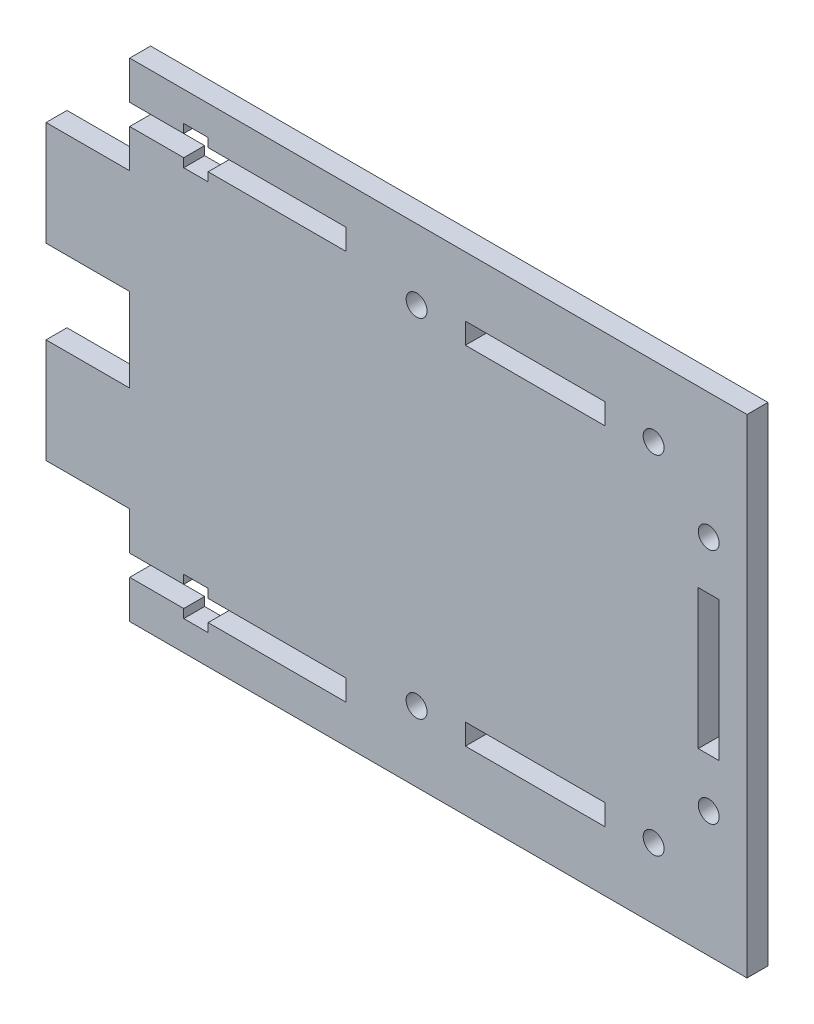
ISO-10303-21;
HEADER;
FILE_DESCRIPTION(('STEP AP214'),'2;1');
FILE_NAME('part.step','',(''),(''),'','','');
FILE_SCHEMA(('AUTOMOTIVE_DESIGN { 1 0 10303 214 1 1 1 1 }'));
ENDSEC;
DATA;
#1=APPLICATION_CONTEXT('core data for automotive mechanical design processes');
#2=APPLICATION_PROTOCOL_DEFINITION('international standard','automotive_design',2000,#1);
#3=PRODUCT_CONTEXT('',#1,'mechanical');
#4=PRODUCT('Part','Part','',(#3));
#5=PRODUCT_RELATED_PRODUCT_CATEGORY('part','',(#4));
#6=PRODUCT_DEFINITION_FORMATION('','',#4);
#7=PRODUCT_DEFINITION_CONTEXT('part definition',#1,'design');
#8=PRODUCT_DEFINITION('design','',#6,#7);
#9=PRODUCT_DEFINITION_SHAPE('','',#8);
#10=(LENGTH_UNIT() NAMED_UNIT(*) SI_UNIT(.MILLI.,.METRE.));
#11=(NAMED_UNIT(*) PLANE_ANGLE_UNIT() SI_UNIT($,.RADIAN.));
#12=(NAMED_UNIT(*) SI_UNIT($,.STERADIAN.) SOLID_ANGLE_UNIT());
#13=UNCERTAINTY_MEASURE_WITH_UNIT(LENGTH_MEASURE(1.E-05),#10,'distance_accuracy_value','');
#14=(GEOMETRIC_REPRESENTATION_CONTEXT(3) GLOBAL_UNCERTAINTY_ASSIGNED_CONTEXT((#13)) GLOBAL_UNIT_ASSIGNED_CONTEXT((#10,
#11,#12)) REPRESENTATION_CONTEXT('',''));
#15=CARTESIAN_POINT('',(0.,0.,0.));
#16=DIRECTION('',(0.,0.,1.));
#17=DIRECTION('',(1.,0.,0.));
#18=AXIS2_PLACEMENT_3D('',#15,#16,#17);
#19=CARTESIAN_POINT('',(9.8750000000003,0.,3.));
#20=DIRECTION('',(1.,0.,0.));
#21=DIRECTION('',(0.,0.,-1.));
#22=AXIS2_PLACEMENT_3D('',#19,#20,#21);
#23=PLANE('',#22);
#24=DIRECTION('',(0.,-1.,0.));
#25=VECTOR('',#24,1.);
#26=CARTESIAN_POINT('',(9.8750000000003,0.,0.));
#27=LINE('',#26,#25);
#28=CARTESIAN_POINT('',(9.8750000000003,-23.4000000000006,0.));
#29=VERTEX_POINT('',#28);
#30=CARTESIAN_POINT('',(9.8750000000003,-26.4000000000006,0.));
#31=VERTEX_POINT('',#30);
#32=EDGE_CURVE('E586',#29,#31,#27,.T.);
#33=ORIENTED_EDGE('',*,*,#32,.F.);
#34=DIRECTION('',(0.,0.,-1.));
#35=VECTOR('',#34,1.);
#36=CARTESIAN_POINT('',(9.8750000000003,-23.4000000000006,3.));
#37=LINE('',#36,#35);
#38=CARTESIAN_POINT('',(9.8750000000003,-23.4000000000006,3.));
#39=VERTEX_POINT('',#38);
#40=EDGE_CURVE('E11',#39,#29,#37,.T.);
#41=ORIENTED_EDGE('',*,*,#40,.F.);
#42=DIRECTION('',(0.,-1.,0.));
#43=VECTOR('',#42,1.);
#44=CARTESIAN_POINT('',(9.8750000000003,0.,3.));
#45=LINE('',#44,#43);
#46=CARTESIAN_POINT('',(9.8750000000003,-26.4000000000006,3.));
#47=VERTEX_POINT('',#46);
#48=EDGE_CURVE('E360',#39,#47,#45,.T.);
#49=ORIENTED_EDGE('',*,*,#48,.T.);
#50=DIRECTION('',(0.,0.,-1.));
#51=VECTOR('',#50,1.);
#52=CARTESIAN_POINT('',(9.8750000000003,-26.4000000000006,3.));
#53=LINE('',#52,#51);
#54=EDGE_CURVE('E53',#47,#31,#53,.T.);
#55=ORIENTED_EDGE('',*,*,#54,.T.);
#56=EDGE_LOOP('',(#33,#41,#49,#55));
#57=FACE_BOUND('',#56,.T.);
#58=ADVANCED_FACE('F34',(#57),#23,.T.);
#59=CARTESIAN_POINT('',(0.,-23.4000000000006,3.));
#60=DIRECTION('',(0.,1.,0.));
#61=DIRECTION('',(0.,0.,1.));
#62=AXIS2_PLACEMENT_3D('',#59,#60,#61);
#63=PLANE('',#62);
#64=DIRECTION('',(1.,0.,0.));
#65=VECTOR('',#64,1.);
#66=CARTESIAN_POINT('',(0.,-23.4000000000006,0.));
#67=LINE('',#66,#65);
#68=CARTESIAN_POINT('',(29.8750000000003,-23.4000000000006,0.));
#69=VERTEX_POINT('',#68);
#70=EDGE_CURVE('E365',#29,#69,#67,.T.);
#71=ORIENTED_EDGE('',*,*,#70,.T.);
#72=DIRECTION('',(0.,0.,-1.));
#73=VECTOR('',#72,1.);
#74=CARTESIAN_POINT('',(29.8750000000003,-23.4000000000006,3.));
#75=LINE('',#74,#73);
#76=CARTESIAN_POINT('',(29.8750000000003,-23.4000000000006,3.));
#77=VERTEX_POINT('',#76);
#78=EDGE_CURVE('E44',#77,#69,#75,.T.);
#79=ORIENTED_EDGE('',*,*,#78,.F.);
#80=DIRECTION('',(1.,0.,0.));
#81=VECTOR('',#80,1.);
#82=CARTESIAN_POINT('',(0.,-23.4000000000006,3.));
#83=LINE('',#82,#81);
#84=EDGE_CURVE('E354',#39,#77,#83,.T.);
#85=ORIENTED_EDGE('',*,*,#84,.F.);
#86=ORIENTED_EDGE('',*,*,#40,.T.);
#87=EDGE_LOOP('',(#71,#79,#85,#86));
#88=FACE_BOUND('',#87,.T.);
#89=ADVANCED_FACE('F363',(#88),#63,.F.);
#90=CARTESIAN_POINT('',(29.8750000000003,0.,3.));
#91=DIRECTION('',(1.,0.,0.));
#92=DIRECTION('',(0.,0.,-1.));
#93=AXIS2_PLACEMENT_3D('',#90,#91,#92);
#94=PLANE('',#93);
#95=DIRECTION('',(0.,-1.,0.));
#96=VECTOR('',#95,1.);
#97=CARTESIAN_POINT('',(29.8750000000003,0.,0.));
#98=LINE('',#97,#96);
#99=CARTESIAN_POINT('',(29.8750000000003,-26.4000000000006,0.));
#100=VERTEX_POINT('',#99);
#101=EDGE_CURVE('E589',#69,#100,#98,.T.);
#102=ORIENTED_EDGE('',*,*,#101,.T.);
#103=DIRECTION('',(0.,0.,-1.));
#104=VECTOR('',#103,1.);
#105=CARTESIAN_POINT('',(29.8750000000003,-26.4000000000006,3.));
#106=LINE('',#105,#104);
#107=CARTESIAN_POINT('',(29.8750000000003,-26.4000000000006,3.));
#108=VERTEX_POINT('',#107);
#109=EDGE_CURVE('E199',#108,#100,#106,.T.);
#110=ORIENTED_EDGE('',*,*,#109,.F.);
#111=DIRECTION('',(0.,-1.,0.));
#112=VECTOR('',#111,1.);
#113=CARTESIAN_POINT('',(29.8750000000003,0.,3.));
#114=LINE('',#113,#112);
#115=EDGE_CURVE('E346',#77,#108,#114,.T.);
#116=ORIENTED_EDGE('',*,*,#115,.F.);
#117=ORIENTED_EDGE('',*,*,#78,.T.);
#118=EDGE_LOOP('',(#102,#110,#116,#117));
#119=FACE_BOUND('',#118,.T.);
#120=ADVANCED_FACE('F348',(#119),#94,.F.);
#121=CARTESIAN_POINT('',(-38.2750000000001,0.,3.));
#122=DIRECTION('',(1.,0.,0.));
#123=DIRECTION('',(0.,0.,-1.));
#124=AXIS2_PLACEMENT_3D('',#121,#122,#123);
#125=PLANE('',#124);
#126=DIRECTION('',(0.,-1.,0.));
#127=VECTOR('',#126,1.);
#128=CARTESIAN_POINT('',(-38.2750000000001,0.,0.));
#129=LINE('',#128,#127);
#130=CARTESIAN_POINT('',(-38.2750000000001,26.5,0.));
#131=VERTEX_POINT('',#130);
#132=CARTESIAN_POINT('',(-38.2750000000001,21.,0.));
#133=VERTEX_POINT('',#132);
#134=EDGE_CURVE('E509',#131,#133,#129,.T.);
#135=ORIENTED_EDGE('',*,*,#134,.T.);
#136=DIRECTION('',(0.,0.,-1.));
#137=VECTOR('',#136,1.);
#138=CARTESIAN_POINT('',(-38.2750000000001,21.,3.));
#139=LINE('',#138,#137);
#140=CARTESIAN_POINT('',(-38.2750000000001,21.,3.));
#141=VERTEX_POINT('',#140);
#142=EDGE_CURVE('E452',#141,#133,#139,.T.);
#143=ORIENTED_EDGE('',*,*,#142,.F.);
#144=DIRECTION('',(0.,-1.,0.));
#145=VECTOR('',#144,1.);
#146=CARTESIAN_POINT('',(-38.2750000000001,0.,3.));
#147=LINE('',#146,#145);
#148=CARTESIAN_POINT('',(-38.2750000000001,26.5,3.));
#149=VERTEX_POINT('',#148);
#150=EDGE_CURVE('E635',#149,#141,#147,.T.);
#151=ORIENTED_EDGE('',*,*,#150,.F.);
#152=DIRECTION('',(0.,0.,-1.));
#153=VECTOR('',#152,1.);
#154=CARTESIAN_POINT('',(-38.2750000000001,26.5,3.));
#155=LINE('',#154,#153);
#156=EDGE_CURVE('E370',#149,#131,#155,.T.);
#157=ORIENTED_EDGE('',*,*,#156,.T.);
#158=EDGE_LOOP('',(#135,#143,#151,#157));
#159=FACE_BOUND('',#158,.T.);
#160=ADVANCED_FACE('F790',(#159),#125,.F.);
#161=CARTESIAN_POINT('',(0.,21.,3.));
#162=DIRECTION('',(0.,1.,0.));
#163=DIRECTION('',(0.,0.,1.));
#164=AXIS2_PLACEMENT_3D('',#161,#162,#163);
#165=PLANE('',#164);
#166=DIRECTION('',(1.,0.,0.));
#167=VECTOR('',#166,1.);
#168=CARTESIAN_POINT('',(0.,21.,0.));
#169=LINE('',#168,#167);
#170=CARTESIAN_POINT('',(-50.275,21.,0.));
#171=VERTEX_POINT('',#170);
#172=EDGE_CURVE('E512',#171,#133,#169,.T.);
#173=ORIENTED_EDGE('',*,*,#172,.F.);
#174=DIRECTION('',(0.,0.,-1.));
#175=VECTOR('',#174,1.);
#176=CARTESIAN_POINT('',(-50.275,21.,3.));
#177=LINE('',#176,#175);
#178=CARTESIAN_POINT('',(-50.275,21.,3.));
#179=VERTEX_POINT('',#178);
#180=EDGE_CURVE('E450',#179,#171,#177,.T.);
#181=ORIENTED_EDGE('',*,*,#180,.F.);
#182=DIRECTION('',(1.,0.,0.));
#183=VECTOR('',#182,1.);
#184=CARTESIAN_POINT('',(0.,21.,3.));
#185=LINE('',#184,#183);
#186=EDGE_CURVE('E637',#179,#141,#185,.T.);
#187=ORIENTED_EDGE('',*,*,#186,.T.);
#188=ORIENTED_EDGE('',*,*,#142,.T.);
#189=EDGE_LOOP('',(#173,#181,#187,#188));
#190=FACE_BOUND('',#189,.T.);
#191=ADVANCED_FACE('F856',(#190),#165,.T.);
#192=CARTESIAN_POINT('',(-50.275,0.,3.));
#193=DIRECTION('',(-1.,0.,0.));
#194=DIRECTION('',(0.,0.,1.));
#195=AXIS2_PLACEMENT_3D('',#192,#193,#194);
#196=PLANE('',#195);
#197=DIRECTION('',(0.,1.,0.));
#198=VECTOR('',#197,1.);
#199=CARTESIAN_POINT('',(-50.275,0.,0.));
#200=LINE('',#199,#198);
#201=CARTESIAN_POINT('',(-50.275,6.00000000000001,0.));
#202=VERTEX_POINT('',#201);
#203=EDGE_CURVE('E517',#202,#171,#200,.T.);
#204=ORIENTED_EDGE('',*,*,#203,.F.);
#205=DIRECTION('',(0.,0.,-1.));
#206=VECTOR('',#205,1.);
#207=CARTESIAN_POINT('',(-50.275,6.00000000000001,3.));
#208=LINE('',#207,#206);
#209=CARTESIAN_POINT('',(-50.275,6.00000000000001,3.));
#210=VERTEX_POINT('',#209);
#211=EDGE_CURVE('E448',#210,#202,#208,.T.);
#212=ORIENTED_EDGE('',*,*,#211,.F.);
#213=DIRECTION('',(0.,1.,0.));
#214=VECTOR('',#213,1.);
#215=CARTESIAN_POINT('',(-50.275,0.,3.));
#216=LINE('',#215,#214);
#217=EDGE_CURVE('E642',#210,#179,#216,.T.);
#218=ORIENTED_EDGE('',*,*,#217,.T.);
#219=ORIENTED_EDGE('',*,*,#180,.T.);
#220=EDGE_LOOP('',(#204,#212,#218,#219));
#221=FACE_BOUND('',#220,.T.);
#222=ADVANCED_FACE('F852',(#221),#196,.T.);
#223=CARTESIAN_POINT('',(0.,6.00000000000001,3.));
#224=DIRECTION('',(0.,1.,0.));
#225=DIRECTION('',(0.,0.,1.));
#226=AXIS2_PLACEMENT_3D('',#223,#224,#225);
#227=PLANE('',#226);
#228=DIRECTION('',(1.,0.,0.));
#229=VECTOR('',#228,1.);
#230=CARTESIAN_POINT('',(0.,6.00000000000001,0.));
#231=LINE('',#230,#229);
#232=CARTESIAN_POINT('',(-38.2750000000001,6.00000000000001,0.));
#233=VERTEX_POINT('',#232);
#234=EDGE_CURVE('E520',#202,#233,#231,.T.);
#235=ORIENTED_EDGE('',*,*,#234,.T.);
#236=DIRECTION('',(0.,0.,-1.));
#237=VECTOR('',#236,1.);
#238=CARTESIAN_POINT('',(-38.2750000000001,6.00000000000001,3.));
#239=LINE('',#238,#237);
#240=CARTESIAN_POINT('',(-38.2750000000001,6.00000000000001,3.));
#241=VERTEX_POINT('',#240);
#242=EDGE_CURVE('E445',#241,#233,#239,.T.);
#243=ORIENTED_EDGE('',*,*,#242,.F.);
#244=DIRECTION('',(1.,0.,0.));
#245=VECTOR('',#244,1.);
#246=CARTESIAN_POINT('',(0.,6.00000000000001,3.));
#247=LINE('',#246,#245);
#248=EDGE_CURVE('E645',#210,#241,#247,.T.);
#249=ORIENTED_EDGE('',*,*,#248,.F.);
#250=ORIENTED_EDGE('',*,*,#211,.T.);
#251=EDGE_LOOP('',(#235,#243,#249,#250));
#252=FACE_BOUND('',#251,.T.);
#253=ADVANCED_FACE('F849',(#252),#227,.F.);
#254=CARTESIAN_POINT('',(-38.2749999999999,-6.00000000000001,0.));
#255=VERTEX_POINT('',#254);
#256=EDGE_CURVE('E514',#233,#255,#129,.T.);
#257=ORIENTED_EDGE('',*,*,#256,.T.);
#258=DIRECTION('',(0.,0.,-1.));
#259=VECTOR('',#258,1.);
#260=CARTESIAN_POINT('',(-38.2749999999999,-6.00000000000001,3.));
#261=LINE('',#260,#259);
#262=CARTESIAN_POINT('',(-38.2749999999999,-6.00000000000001,3.));
#263=VERTEX_POINT('',#262);
#264=EDGE_CURVE('E443',#263,#255,#261,.T.);
#265=ORIENTED_EDGE('',*,*,#264,.F.);
#266=EDGE_CURVE('E639',#241,#263,#147,.T.);
#267=ORIENTED_EDGE('',*,*,#266,.F.);
#268=ORIENTED_EDGE('',*,*,#242,.T.);
#269=EDGE_LOOP('',(#257,#265,#267,#268));
#270=FACE_BOUND('',#269,.T.);
#271=ADVANCED_FACE('F847',(#270),#125,.F.);
#272=CARTESIAN_POINT('',(0.,-6.00000000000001,3.));
#273=DIRECTION('',(0.,1.,0.));
#274=DIRECTION('',(0.,0.,1.));
#275=AXIS2_PLACEMENT_3D('',#272,#273,#274);
#276=PLANE('',#275);
#277=DIRECTION('',(1.,0.,0.));
#278=VECTOR('',#277,1.);
#279=CARTESIAN_POINT('',(0.,-6.00000000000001,0.));
#280=LINE('',#279,#278);
#281=CARTESIAN_POINT('',(-50.275,-6.00000000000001,0.));
#282=VERTEX_POINT('',#281);
#283=EDGE_CURVE('E522',#282,#255,#280,.T.);
#284=ORIENTED_EDGE('',*,*,#283,.F.);
#285=DIRECTION('',(0.,0.,-1.));
#286=VECTOR('',#285,1.);
#287=CARTESIAN_POINT('',(-50.275,-6.00000000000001,3.));
#288=LINE('',#287,#286);
#289=CARTESIAN_POINT('',(-50.275,-6.00000000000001,3.));
#290=VERTEX_POINT('',#289);
#291=EDGE_CURVE('E441',#290,#282,#288,.T.);
#292=ORIENTED_EDGE('',*,*,#291,.F.);
#293=DIRECTION('',(1.,0.,0.));
#294=VECTOR('',#293,1.);
#295=CARTESIAN_POINT('',(0.,-6.00000000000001,3.));
#296=LINE('',#295,#294);
#297=EDGE_CURVE('E647',#290,#263,#296,.T.);
#298=ORIENTED_EDGE('',*,*,#297,.T.);
#299=ORIENTED_EDGE('',*,*,#264,.T.);
#300=EDGE_LOOP('',(#284,#292,#298,#299));
#301=FACE_BOUND('',#300,.T.);
#302=ADVANCED_FACE('F843',(#301),#276,.T.);
#303=CARTESIAN_POINT('',(-50.275,0.,3.));
#304=DIRECTION('',(1.,0.,0.));
#305=DIRECTION('',(0.,0.,-1.));
#306=AXIS2_PLACEMENT_3D('',#303,#304,#305);
#307=PLANE('',#306);
#308=DIRECTION('',(0.,-1.,0.));
#309=VECTOR('',#308,1.);
#310=CARTESIAN_POINT('',(-50.275,0.,0.));
#311=LINE('',#310,#309);
#312=CARTESIAN_POINT('',(-50.275,-21.,0.));
#313=VERTEX_POINT('',#312);
#314=EDGE_CURVE('E525',#282,#313,#311,.T.);
#315=ORIENTED_EDGE('',*,*,#314,.T.);
#316=DIRECTION('',(0.,0.,-1.));
#317=VECTOR('',#316,1.);
#318=CARTESIAN_POINT('',(-50.275,-21.,3.));
#319=LINE('',#318,#317);
#320=CARTESIAN_POINT('',(-50.275,-21.,3.));
#321=VERTEX_POINT('',#320);
#322=EDGE_CURVE('E438',#321,#313,#319,.T.);
#323=ORIENTED_EDGE('',*,*,#322,.F.);
#324=DIRECTION('',(0.,-1.,0.));
#325=VECTOR('',#324,1.);
#326=CARTESIAN_POINT('',(-50.275,0.,3.));
#327=LINE('',#326,#325);
#328=EDGE_CURVE('E650',#290,#321,#327,.T.);
#329=ORIENTED_EDGE('',*,*,#328,.F.);
#330=ORIENTED_EDGE('',*,*,#291,.T.);
#331=EDGE_LOOP('',(#315,#323,#329,#330));
#332=FACE_BOUND('',#331,.T.);
#333=ADVANCED_FACE('F839',(#332),#307,.F.);
#334=CARTESIAN_POINT('',(0.,-21.,3.));
#335=DIRECTION('',(0.,1.,0.));
#336=DIRECTION('',(0.,0.,1.));
#337=AXIS2_PLACEMENT_3D('',#334,#335,#336);
#338=PLANE('',#337);
#339=DIRECTION('',(1.,0.,0.));
#340=VECTOR('',#339,1.);
#341=CARTESIAN_POINT('',(0.,-21.,0.));
#342=LINE('',#341,#340);
#343=CARTESIAN_POINT('',(-38.2749999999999,-21.,0.));
#344=VERTEX_POINT('',#343);
#345=EDGE_CURVE('E527',#313,#344,#342,.T.);
#346=ORIENTED_EDGE('',*,*,#345,.T.);
#347=DIRECTION('',(0.,0.,-1.));
#348=VECTOR('',#347,1.);
#349=CARTESIAN_POINT('',(-38.2749999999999,-21.,3.));
#350=LINE('',#349,#348);
#351=CARTESIAN_POINT('',(-38.2749999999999,-21.,3.));
#352=VERTEX_POINT('',#351);
#353=EDGE_CURVE('E435',#352,#344,#350,.T.);
#354=ORIENTED_EDGE('',*,*,#353,.F.);
#355=DIRECTION('',(1.,0.,0.));
#356=VECTOR('',#355,1.);
#357=CARTESIAN_POINT('',(0.,-21.,3.));
#358=LINE('',#357,#356);
#359=EDGE_CURVE('E652',#321,#352,#358,.T.);
#360=ORIENTED_EDGE('',*,*,#359,.F.);
#361=ORIENTED_EDGE('',*,*,#322,.T.);
#362=EDGE_LOOP('',(#346,#354,#360,#361));
#363=FACE_BOUND('',#362,.T.);
#364=ADVANCED_FACE('F835',(#363),#338,.F.);
#365=CARTESIAN_POINT('',(-38.2750000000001,-26.5,0.));
#366=VERTEX_POINT('',#365);
#367=EDGE_CURVE('E529',#344,#366,#129,.T.);
#368=ORIENTED_EDGE('',*,*,#367,.T.);
#369=DIRECTION('',(0.,0.,-1.));
#370=VECTOR('',#369,1.);
#371=CARTESIAN_POINT('',(-38.2750000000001,-26.5,3.));
#372=LINE('',#371,#370);
#373=CARTESIAN_POINT('',(-38.2750000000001,-26.5,3.));
#374=VERTEX_POINT('',#373);
#375=EDGE_CURVE('E432',#374,#366,#372,.T.);
#376=ORIENTED_EDGE('',*,*,#375,.F.);
#377=EDGE_CURVE('E654',#352,#374,#147,.T.);
#378=ORIENTED_EDGE('',*,*,#377,.F.);
#379=ORIENTED_EDGE('',*,*,#353,.T.);
#380=EDGE_LOOP('',(#368,#376,#378,#379));
#381=FACE_BOUND('',#380,.T.);
#382=ADVANCED_FACE('F838',(#381),#125,.F.);
#383=CARTESIAN_POINT('',(0.,-26.5,3.));
#384=DIRECTION('',(0.,1.,0.));
#385=DIRECTION('',(0.,0.,1.));
#386=AXIS2_PLACEMENT_3D('',#383,#384,#385);
#387=PLANE('',#386);
#388=DIRECTION('',(1.,0.,0.));
#389=VECTOR('',#388,1.);
#390=CARTESIAN_POINT('',(0.,-26.5,0.));
#391=LINE('',#390,#389);
#392=CARTESIAN_POINT('',(-30.5249999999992,-26.5,0.));
#393=VERTEX_POINT('',#392);
#394=EDGE_CURVE('E530',#366,#393,#391,.T.);
#395=ORIENTED_EDGE('',*,*,#394,.T.);
#396=DIRECTION('',(0.,0.,-1.));
#397=VECTOR('',#396,1.);
#398=CARTESIAN_POINT('',(-30.5249999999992,-26.5,3.));
#399=LINE('',#398,#397);
#400=CARTESIAN_POINT('',(-30.5249999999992,-26.5,3.));
#401=VERTEX_POINT('',#400);
#402=EDGE_CURVE('E430',#401,#393,#399,.T.);
#403=ORIENTED_EDGE('',*,*,#402,.F.);
#404=DIRECTION('',(1.,0.,0.));
#405=VECTOR('',#404,1.);
#406=CARTESIAN_POINT('',(0.,-26.5,3.));
#407=LINE('',#406,#405);
#408=EDGE_CURVE('E655',#374,#401,#407,.T.);
#409=ORIENTED_EDGE('',*,*,#408,.F.);
#410=ORIENTED_EDGE('',*,*,#375,.T.);
#411=EDGE_LOOP('',(#395,#403,#409,#410));
#412=FACE_BOUND('',#411,.T.);
#413=ADVANCED_FACE('F830',(#412),#387,.F.);
#414=CARTESIAN_POINT('',(-30.5249999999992,0.,3.));
#415=DIRECTION('',(1.,0.,0.));
#416=DIRECTION('',(0.,0.,-1.));
#417=AXIS2_PLACEMENT_3D('',#414,#415,#416);
#418=PLANE('',#417);
#419=DIRECTION('',(0.,-1.,0.));
#420=VECTOR('',#419,1.);
#421=CARTESIAN_POINT('',(-30.5249999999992,0.,0.));
#422=LINE('',#421,#420);
#423=CARTESIAN_POINT('',(-30.5249999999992,-25.25,0.));
#424=VERTEX_POINT('',#423);
#425=EDGE_CURVE('E533',#424,#393,#422,.T.);
#426=ORIENTED_EDGE('',*,*,#425,.F.);
#427=DIRECTION('',(0.,0.,-1.));
#428=VECTOR('',#427,1.);
#429=CARTESIAN_POINT('',(-30.5249999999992,-25.25,3.));
#430=LINE('',#429,#428);
#431=CARTESIAN_POINT('',(-30.5249999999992,-25.25,3.));
#432=VERTEX_POINT('',#431);
#433=EDGE_CURVE('E428',#432,#424,#430,.T.);
#434=ORIENTED_EDGE('',*,*,#433,.F.);
#435=DIRECTION('',(0.,-1.,0.));
#436=VECTOR('',#435,1.);
#437=CARTESIAN_POINT('',(-30.5249999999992,0.,3.));
#438=LINE('',#437,#436);
#439=EDGE_CURVE('E657',#432,#401,#438,.T.);
#440=ORIENTED_EDGE('',*,*,#439,.T.);
#441=ORIENTED_EDGE('',*,*,#402,.T.);
#442=EDGE_LOOP('',(#426,#434,#440,#441));
#443=FACE_BOUND('',#442,.T.);
#444=ADVANCED_FACE('F813',(#443),#418,.T.);
#445=CARTESIAN_POINT('',(0.,-25.25,3.));
#446=DIRECTION('',(0.,1.,0.));
#447=DIRECTION('',(0.,0.,1.));
#448=AXIS2_PLACEMENT_3D('',#445,#446,#447);
#449=PLANE('',#448);
#450=DIRECTION('',(1.,0.,0.));
#451=VECTOR('',#450,1.);
#452=CARTESIAN_POINT('',(0.,-25.25,0.));
#453=LINE('',#452,#451);
#454=CARTESIAN_POINT('',(-27.0249999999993,-25.25,0.));
#455=VERTEX_POINT('',#454);
#456=EDGE_CURVE('E537',#424,#455,#453,.T.);
#457=ORIENTED_EDGE('',*,*,#456,.T.);
#458=DIRECTION('',(0.,0.,-1.));
#459=VECTOR('',#458,1.);
#460=CARTESIAN_POINT('',(-27.0249999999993,-25.25,3.));
#461=LINE('',#460,#459);
#462=CARTESIAN_POINT('',(-27.0249999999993,-25.25,3.));
#463=VERTEX_POINT('',#462);
#464=EDGE_CURVE('E425',#463,#455,#461,.T.);
#465=ORIENTED_EDGE('',*,*,#464,.F.);
#466=DIRECTION('',(1.,0.,0.));
#467=VECTOR('',#466,1.);
#468=CARTESIAN_POINT('',(0.,-25.25,3.));
#469=LINE('',#468,#467);
#470=EDGE_CURVE('E661',#432,#463,#469,.T.);
#471=ORIENTED_EDGE('',*,*,#470,.F.);
#472=ORIENTED_EDGE('',*,*,#433,.T.);
#473=EDGE_LOOP('',(#457,#465,#471,#472));
#474=FACE_BOUND('',#473,.T.);
#475=ADVANCED_FACE('F831',(#474),#449,.F.);
#476=CARTESIAN_POINT('',(-27.0249999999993,0.,3.));
#477=DIRECTION('',(1.,0.,0.));
#478=DIRECTION('',(0.,0.,-1.));
#479=AXIS2_PLACEMENT_3D('',#476,#477,#478);
#480=PLANE('',#479);
#481=DIRECTION('',(0.,-1.,0.));
#482=VECTOR('',#481,1.);
#483=CARTESIAN_POINT('',(-27.0249999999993,0.,0.));
#484=LINE('',#483,#482);
#485=CARTESIAN_POINT('',(-27.0249999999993,-26.5,0.));
#486=VERTEX_POINT('',#485);
#487=EDGE_CURVE('E540',#455,#486,#484,.T.);
#488=ORIENTED_EDGE('',*,*,#487,.T.);
#489=DIRECTION('',(0.,0.,-1.));
#490=VECTOR('',#489,1.);
#491=CARTESIAN_POINT('',(-27.0249999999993,-26.5,3.));
#492=LINE('',#491,#490);
#493=CARTESIAN_POINT('',(-27.0249999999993,-26.5,3.));
#494=VERTEX_POINT('',#493);
#495=EDGE_CURVE('E422',#494,#486,#492,.T.);
#496=ORIENTED_EDGE('',*,*,#495,.F.);
#497=DIRECTION('',(0.,-1.,0.));
#498=VECTOR('',#497,1.);
#499=CARTESIAN_POINT('',(-27.0249999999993,0.,3.));
#500=LINE('',#499,#498);
#501=EDGE_CURVE('E664',#463,#494,#500,.T.);
#502=ORIENTED_EDGE('',*,*,#501,.F.);
#503=ORIENTED_EDGE('',*,*,#464,.T.);
#504=EDGE_LOOP('',(#488,#496,#502,#503));
#505=FACE_BOUND('',#504,.T.);
#506=ADVANCED_FACE('F821',(#505),#480,.F.);
#507=CARTESIAN_POINT('',(-7.27500000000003,-26.5,0.));
#508=VERTEX_POINT('',#507);
#509=EDGE_CURVE('E534',#486,#508,#391,.T.);
#510=ORIENTED_EDGE('',*,*,#509,.T.);
#511=DIRECTION('',(0.,0.,-1.));
#512=VECTOR('',#511,1.);
#513=CARTESIAN_POINT('',(-7.27500000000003,-26.5,3.));
#514=LINE('',#513,#512);
#515=CARTESIAN_POINT('',(-7.27500000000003,-26.5,3.));
#516=VERTEX_POINT('',#515);
#517=EDGE_CURVE('E419',#516,#508,#514,.T.);
#518=ORIENTED_EDGE('',*,*,#517,.F.);
#519=EDGE_CURVE('E658',#494,#516,#407,.T.);
#520=ORIENTED_EDGE('',*,*,#519,.F.);
#521=ORIENTED_EDGE('',*,*,#495,.T.);
#522=EDGE_LOOP('',(#510,#518,#520,#521));
#523=FACE_BOUND('',#522,.T.);
#524=ADVANCED_FACE('F825',(#523),#387,.F.);
#525=CARTESIAN_POINT('',(-7.27500000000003,0.,3.));
#526=DIRECTION('',(1.,0.,0.));
#527=DIRECTION('',(0.,0.,-1.));
#528=AXIS2_PLACEMENT_3D('',#525,#526,#527);
#529=PLANE('',#528);
#530=DIRECTION('',(0.,-1.,0.));
#531=VECTOR('',#530,1.);
#532=CARTESIAN_POINT('',(-7.27500000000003,0.,0.));
#533=LINE('',#532,#531);
#534=CARTESIAN_POINT('',(-7.27500000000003,-29.5,0.));
#535=VERTEX_POINT('',#534);
#536=EDGE_CURVE('E543',#508,#535,#533,.T.);
#537=ORIENTED_EDGE('',*,*,#536,.T.);
#538=DIRECTION('',(0.,0.,-1.));
#539=VECTOR('',#538,1.);
#540=CARTESIAN_POINT('',(-7.27500000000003,-29.5,3.));
#541=LINE('',#540,#539);
#542=CARTESIAN_POINT('',(-7.27500000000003,-29.5,3.));
#543=VERTEX_POINT('',#542);
#544=EDGE_CURVE('E417',#543,#535,#541,.T.);
#545=ORIENTED_EDGE('',*,*,#544,.F.);
#546=DIRECTION('',(0.,-1.,0.));
#547=VECTOR('',#546,1.);
#548=CARTESIAN_POINT('',(-7.27500000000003,0.,3.));
#549=LINE('',#548,#547);
#550=EDGE_CURVE('E667',#516,#543,#549,.T.);
#551=ORIENTED_EDGE('',*,*,#550,.F.);
#552=ORIENTED_EDGE('',*,*,#517,.T.);
#553=EDGE_LOOP('',(#537,#545,#551,#552));
#554=FACE_BOUND('',#553,.T.);
#555=ADVANCED_FACE('F822',(#554),#529,.F.);
#556=CARTESIAN_POINT('',(0.,-29.5,3.));
#557=DIRECTION('',(0.,1.,0.));
#558=DIRECTION('',(0.,0.,1.));
#559=AXIS2_PLACEMENT_3D('',#556,#557,#558);
#560=PLANE('',#559);
#561=DIRECTION('',(1.,0.,0.));
#562=VECTOR('',#561,1.);
#563=CARTESIAN_POINT('',(0.,-29.5,0.));
#564=LINE('',#563,#562);
#565=CARTESIAN_POINT('',(-27.0249999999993,-29.5,0.));
#566=VERTEX_POINT('',#565);
#567=EDGE_CURVE('E546',#566,#535,#564,.T.);
#568=ORIENTED_EDGE('',*,*,#567,.F.);
#569=DIRECTION('',(0.,0.,-1.));
#570=VECTOR('',#569,1.);
#571=CARTESIAN_POINT('',(-27.0249999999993,-29.5,3.));
#572=LINE('',#571,#570);
#573=CARTESIAN_POINT('',(-27.0249999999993,-29.5,3.));
#574=VERTEX_POINT('',#573);
#575=EDGE_CURVE('E415',#574,#566,#572,.T.);
#576=ORIENTED_EDGE('',*,*,#575,.F.);
#577=DIRECTION('',(1.,0.,0.));
#578=VECTOR('',#577,1.);
#579=CARTESIAN_POINT('',(0.,-29.5,3.));
#580=LINE('',#579,#578);
#581=EDGE_CURVE('E669',#574,#543,#580,.T.);
#582=ORIENTED_EDGE('',*,*,#581,.T.);
#583=ORIENTED_EDGE('',*,*,#544,.T.);
#584=EDGE_LOOP('',(#568,#576,#582,#583));
#585=FACE_BOUND('',#584,.T.);
#586=ADVANCED_FACE('F808',(#585),#560,.T.);
#587=CARTESIAN_POINT('',(-27.0249999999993,-30.7499999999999,0.));
#588=VERTEX_POINT('',#587);
#589=EDGE_CURVE('E542',#566,#588,#484,.T.);
#590=ORIENTED_EDGE('',*,*,#589,.T.);
#591=DIRECTION('',(0.,0.,-1.));
#592=VECTOR('',#591,1.);
#593=CARTESIAN_POINT('',(-27.0249999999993,-30.7499999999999,3.));
#594=LINE('',#593,#592);
#595=CARTESIAN_POINT('',(-27.0249999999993,-30.7499999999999,3.));
#596=VERTEX_POINT('',#595);
#597=EDGE_CURVE('E413',#596,#588,#594,.T.);
#598=ORIENTED_EDGE('',*,*,#597,.F.);
#599=EDGE_CURVE('E666',#574,#596,#500,.T.);
#600=ORIENTED_EDGE('',*,*,#599,.F.);
#601=ORIENTED_EDGE('',*,*,#575,.T.);
#602=EDGE_LOOP('',(#590,#598,#600,#601));
#603=FACE_BOUND('',#602,.T.);
#604=ADVANCED_FACE('F816',(#603),#480,.F.);
#605=CARTESIAN_POINT('',(0.,-30.7499999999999,3.));
#606=DIRECTION('',(0.,1.,0.));
#607=DIRECTION('',(0.,0.,1.));
#608=AXIS2_PLACEMENT_3D('',#605,#606,#607);
#609=PLANE('',#608);
#610=DIRECTION('',(1.,0.,0.));
#611=VECTOR('',#610,1.);
#612=CARTESIAN_POINT('',(0.,-30.7499999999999,0.));
#613=LINE('',#612,#611);
#614=CARTESIAN_POINT('',(-30.5249999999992,-30.7499999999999,0.));
#615=VERTEX_POINT('',#614);
#616=EDGE_CURVE('E550',#615,#588,#613,.T.);
#617=ORIENTED_EDGE('',*,*,#616,.F.);
#618=DIRECTION('',(0.,0.,-1.));
#619=VECTOR('',#618,1.);
#620=CARTESIAN_POINT('',(-30.5249999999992,-30.7499999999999,3.));
#621=LINE('',#620,#619);
#622=CARTESIAN_POINT('',(-30.5249999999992,-30.7499999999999,3.));
#623=VERTEX_POINT('',#622);
#624=EDGE_CURVE('E411',#623,#615,#621,.T.);
#625=ORIENTED_EDGE('',*,*,#624,.F.);
#626=DIRECTION('',(1.,0.,0.));
#627=VECTOR('',#626,1.);
#628=CARTESIAN_POINT('',(0.,-30.7499999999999,3.));
#629=LINE('',#628,#627);
#630=EDGE_CURVE('E673',#623,#596,#629,.T.);
#631=ORIENTED_EDGE('',*,*,#630,.T.);
#632=ORIENTED_EDGE('',*,*,#597,.T.);
#633=EDGE_LOOP('',(#617,#625,#631,#632));
#634=FACE_BOUND('',#633,.T.);
#635=ADVANCED_FACE('F811',(#634),#609,.T.);
#636=CARTESIAN_POINT('',(-30.5249999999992,-29.5,0.));
#637=VERTEX_POINT('',#636);
#638=EDGE_CURVE('E538',#637,#615,#422,.T.);
#639=ORIENTED_EDGE('',*,*,#638,.F.);
#640=DIRECTION('',(0.,0.,-1.));
#641=VECTOR('',#640,1.);
#642=CARTESIAN_POINT('',(-30.5249999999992,-29.5,3.));
#643=LINE('',#642,#641);
#644=CARTESIAN_POINT('',(-30.5249999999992,-29.5,3.));
#645=VERTEX_POINT('',#644);
#646=EDGE_CURVE('E409',#645,#637,#643,.T.);
#647=ORIENTED_EDGE('',*,*,#646,.F.);
#648=EDGE_CURVE('E662',#645,#623,#438,.T.);
#649=ORIENTED_EDGE('',*,*,#648,.T.);
#650=ORIENTED_EDGE('',*,*,#624,.T.);
#651=EDGE_LOOP('',(#639,#647,#649,#650));
#652=FACE_BOUND('',#651,.T.);
#653=ADVANCED_FACE('F806',(#652),#418,.T.);
#654=CARTESIAN_POINT('',(-38.2750000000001,-29.5,0.));
#655=VERTEX_POINT('',#654);
#656=EDGE_CURVE('E549',#655,#637,#564,.T.);
#657=ORIENTED_EDGE('',*,*,#656,.F.);
#658=DIRECTION('',(0.,0.,-1.));
#659=VECTOR('',#658,1.);
#660=CARTESIAN_POINT('',(-38.2750000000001,-29.5,3.));
#661=LINE('',#660,#659);
#662=CARTESIAN_POINT('',(-38.2750000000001,-29.5,3.));
#663=VERTEX_POINT('',#662);
#664=EDGE_CURVE('E407',#663,#655,#661,.T.);
#665=ORIENTED_EDGE('',*,*,#664,.F.);
#666=EDGE_CURVE('E672',#663,#645,#580,.T.);
#667=ORIENTED_EDGE('',*,*,#666,.T.);
#668=ORIENTED_EDGE('',*,*,#646,.T.);
#669=EDGE_LOOP('',(#657,#665,#667,#668));
#670=FACE_BOUND('',#669,.T.);
#671=ADVANCED_FACE('F803',(#670),#560,.T.);
#672=CARTESIAN_POINT('',(-38.2750000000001,-35.,0.));
#673=VERTEX_POINT('',#672);
#674=EDGE_CURVE('E557',#655,#673,#129,.T.);
#675=ORIENTED_EDGE('',*,*,#674,.T.);
#676=DIRECTION('',(0.,0.,-1.));
#677=VECTOR('',#676,1.);
#678=CARTESIAN_POINT('',(-38.2750000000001,-35.,3.));
#679=LINE('',#678,#677);
#680=CARTESIAN_POINT('',(-38.2750000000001,-35.,3.));
#681=VERTEX_POINT('',#680);
#682=EDGE_CURVE('E404',#681,#673,#679,.T.);
#683=ORIENTED_EDGE('',*,*,#682,.F.);
#684=EDGE_CURVE('E679',#663,#681,#147,.T.);
#685=ORIENTED_EDGE('',*,*,#684,.F.);
#686=ORIENTED_EDGE('',*,*,#664,.T.);
#687=EDGE_LOOP('',(#675,#683,#685,#686));
#688=FACE_BOUND('',#687,.T.);
#689=ADVANCED_FACE('F791',(#688),#125,.F.);
#690=CARTESIAN_POINT('',(0.,-35.,3.));
#691=DIRECTION('',(0.,1.,0.));
#692=DIRECTION('',(0.,0.,1.));
#693=AXIS2_PLACEMENT_3D('',#690,#691,#692);
#694=PLANE('',#693);
#695=DIRECTION('',(1.,0.,0.));
#696=VECTOR('',#695,1.);
#697=CARTESIAN_POINT('',(0.,-35.,0.));
#698=LINE('',#697,#696);
#699=CARTESIAN_POINT('',(50.275,-35.,0.));
#700=VERTEX_POINT('',#699);
#701=EDGE_CURVE('E553',#673,#700,#698,.T.);
#702=ORIENTED_EDGE('',*,*,#701,.T.);
#703=DIRECTION('',(0.,0.,-1.));
#704=VECTOR('',#703,1.);
#705=CARTESIAN_POINT('',(50.275,-35.,3.));
#706=LINE('',#705,#704);
#707=CARTESIAN_POINT('',(50.275,-35.,3.));
#708=VERTEX_POINT('',#707);
#709=EDGE_CURVE('E402',#708,#700,#706,.T.);
#710=ORIENTED_EDGE('',*,*,#709,.F.);
#711=DIRECTION('',(1.,0.,0.));
#712=VECTOR('',#711,1.);
#713=CARTESIAN_POINT('',(0.,-35.,3.));
#714=LINE('',#713,#712);
#715=EDGE_CURVE('E676',#681,#708,#714,.T.);
#716=ORIENTED_EDGE('',*,*,#715,.F.);
#717=ORIENTED_EDGE('',*,*,#682,.T.);
#718=EDGE_LOOP('',(#702,#710,#716,#717));
#719=FACE_BOUND('',#718,.T.);
#720=ADVANCED_FACE('F798',(#719),#694,.F.);
#721=CARTESIAN_POINT('',(50.275,0.,3.));
#722=DIRECTION('',(1.,0.,0.));
#723=DIRECTION('',(0.,0.,-1.));
#724=AXIS2_PLACEMENT_3D('',#721,#722,#723);
#725=PLANE('',#724);
#726=DIRECTION('',(0.,-1.,0.));
#727=VECTOR('',#726,1.);
#728=CARTESIAN_POINT('',(50.275,0.,0.));
#729=LINE('',#728,#727);
#730=CARTESIAN_POINT('',(50.275,35.,0.));
#731=VERTEX_POINT('',#730);
#732=EDGE_CURVE('E556',#731,#700,#729,.T.);
#733=ORIENTED_EDGE('',*,*,#732,.F.);
#734=DIRECTION('',(0.,0.,-1.));
#735=VECTOR('',#734,1.);
#736=CARTESIAN_POINT('',(50.275,35.,3.));
#737=LINE('',#736,#735);
#738=CARTESIAN_POINT('',(50.275,35.,3.));
#739=VERTEX_POINT('',#738);
#740=EDGE_CURVE('E400',#739,#731,#737,.T.);
#741=ORIENTED_EDGE('',*,*,#740,.F.);
#742=DIRECTION('',(0.,-1.,0.));
#743=VECTOR('',#742,1.);
#744=CARTESIAN_POINT('',(50.275,0.,3.));
#745=LINE('',#744,#743);
#746=EDGE_CURVE('E678',#739,#708,#745,.T.);
#747=ORIENTED_EDGE('',*,*,#746,.T.);
#748=ORIENTED_EDGE('',*,*,#709,.T.);
#749=EDGE_LOOP('',(#733,#741,#747,#748));
#750=FACE_BOUND('',#749,.T.);
#751=ADVANCED_FACE('F794',(#750),#725,.T.);
#752=CARTESIAN_POINT('',(0.,35.,3.));
#753=DIRECTION('',(0.,1.,0.));
#754=DIRECTION('',(0.,0.,1.));
#755=AXIS2_PLACEMENT_3D('',#752,#753,#754);
#756=PLANE('',#755);
#757=DIRECTION('',(1.,0.,0.));
#758=VECTOR('',#757,1.);
#759=CARTESIAN_POINT('',(0.,35.,0.));
#760=LINE('',#759,#758);
#761=CARTESIAN_POINT('',(-38.2750000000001,35.,0.));
#762=VERTEX_POINT('',#761);
#763=EDGE_CURVE('E560',#762,#731,#760,.T.);
#764=ORIENTED_EDGE('',*,*,#763,.F.);
#765=DIRECTION('',(0.,0.,-1.));
#766=VECTOR('',#765,1.);
#767=CARTESIAN_POINT('',(-38.2750000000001,35.,3.));
#768=LINE('',#767,#766);
#769=CARTESIAN_POINT('',(-38.2750000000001,35.,3.));
#770=VERTEX_POINT('',#769);
#771=EDGE_CURVE('E398',#770,#762,#768,.T.);
#772=ORIENTED_EDGE('',*,*,#771,.F.);
#773=DIRECTION('',(1.,0.,0.));
#774=VECTOR('',#773,1.);
#775=CARTESIAN_POINT('',(0.,35.,3.));
#776=LINE('',#775,#774);
#777=EDGE_CURVE('E682',#770,#739,#776,.T.);
#778=ORIENTED_EDGE('',*,*,#777,.T.);
#779=ORIENTED_EDGE('',*,*,#740,.T.);
#780=EDGE_LOOP('',(#764,#772,#778,#779));
#781=FACE_BOUND('',#780,.T.);
#782=ADVANCED_FACE('F788',(#781),#756,.T.);
#783=CARTESIAN_POINT('',(-38.2750000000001,29.5,0.));
#784=VERTEX_POINT('',#783);
#785=EDGE_CURVE('E513',#762,#784,#129,.T.);
#786=ORIENTED_EDGE('',*,*,#785,.T.);
#787=DIRECTION('',(0.,0.,-1.));
#788=VECTOR('',#787,1.);
#789=CARTESIAN_POINT('',(-38.2750000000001,29.5,3.));
#790=LINE('',#789,#788);
#791=CARTESIAN_POINT('',(-38.2750000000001,29.5,3.));
#792=VERTEX_POINT('',#791);
#793=EDGE_CURVE('E395',#792,#784,#790,.T.);
#794=ORIENTED_EDGE('',*,*,#793,.F.);
#795=EDGE_CURVE('E638',#770,#792,#147,.T.);
#796=ORIENTED_EDGE('',*,*,#795,.F.);
#797=ORIENTED_EDGE('',*,*,#771,.T.);
#798=EDGE_LOOP('',(#786,#794,#796,#797));
#799=FACE_BOUND('',#798,.T.);
#800=ADVANCED_FACE('F785',(#799),#125,.F.);
#801=CARTESIAN_POINT('',(0.,29.5,3.));
#802=DIRECTION('',(0.,1.,0.));
#803=DIRECTION('',(0.,0.,1.));
#804=AXIS2_PLACEMENT_3D('',#801,#802,#803);
#805=PLANE('',#804);
#806=DIRECTION('',(1.,0.,0.));
#807=VECTOR('',#806,1.);
#808=CARTESIAN_POINT('',(0.,29.5,0.));
#809=LINE('',#808,#807);
#810=CARTESIAN_POINT('',(-30.5249999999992,29.5,0.));
#811=VERTEX_POINT('',#810);
#812=EDGE_CURVE('E563',#784,#811,#809,.T.);
#813=ORIENTED_EDGE('',*,*,#812,.T.);
#814=DIRECTION('',(0.,0.,-1.));
#815=VECTOR('',#814,1.);
#816=CARTESIAN_POINT('',(-30.5249999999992,29.5,3.));
#817=LINE('',#816,#815);
#818=CARTESIAN_POINT('',(-30.5249999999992,29.5,3.));
#819=VERTEX_POINT('',#818);
#820=EDGE_CURVE('E392',#819,#811,#817,.T.);
#821=ORIENTED_EDGE('',*,*,#820,.F.);
#822=DIRECTION('',(1.,0.,0.));
#823=VECTOR('',#822,1.);
#824=CARTESIAN_POINT('',(0.,29.5,3.));
#825=LINE('',#824,#823);
#826=EDGE_CURVE('E685',#792,#819,#825,.T.);
#827=ORIENTED_EDGE('',*,*,#826,.F.);
#828=ORIENTED_EDGE('',*,*,#793,.T.);
#829=EDGE_LOOP('',(#813,#821,#827,#828));
#830=FACE_BOUND('',#829,.T.);
#831=ADVANCED_FACE('F780',(#830),#805,.F.);
#832=CARTESIAN_POINT('',(-30.5249999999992,0.,3.));
#833=DIRECTION('',(-1.,0.,0.));
#834=DIRECTION('',(0.,0.,1.));
#835=AXIS2_PLACEMENT_3D('',#832,#833,#834);
#836=PLANE('',#835);
#837=DIRECTION('',(0.,1.,0.));
#838=VECTOR('',#837,1.);
#839=CARTESIAN_POINT('',(-30.5249999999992,0.,0.));
#840=LINE('',#839,#838);
#841=CARTESIAN_POINT('',(-30.5249999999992,30.7499999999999,0.));
#842=VERTEX_POINT('',#841);
#843=EDGE_CURVE('E565',#811,#842,#840,.T.);
#844=ORIENTED_EDGE('',*,*,#843,.T.);
#845=DIRECTION('',(0.,0.,-1.));
#846=VECTOR('',#845,1.);
#847=CARTESIAN_POINT('',(-30.5249999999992,30.7499999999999,3.));
#848=LINE('',#847,#846);
#849=CARTESIAN_POINT('',(-30.5249999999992,30.7499999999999,3.));
#850=VERTEX_POINT('',#849);
#851=EDGE_CURVE('E389',#850,#842,#848,.T.);
#852=ORIENTED_EDGE('',*,*,#851,.F.);
#853=DIRECTION('',(0.,1.,0.));
#854=VECTOR('',#853,1.);
#855=CARTESIAN_POINT('',(-30.5249999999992,0.,3.));
#856=LINE('',#855,#854);
#857=EDGE_CURVE('E687',#819,#850,#856,.T.);
#858=ORIENTED_EDGE('',*,*,#857,.F.);
#859=ORIENTED_EDGE('',*,*,#820,.T.);
#860=EDGE_LOOP('',(#844,#852,#858,#859));
#861=FACE_BOUND('',#860,.T.);
#862=ADVANCED_FACE('F763',(#861),#836,.F.);
#863=CARTESIAN_POINT('',(0.,30.7499999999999,3.));
#864=DIRECTION('',(0.,1.,0.));
#865=DIRECTION('',(0.,0.,1.));
#866=AXIS2_PLACEMENT_3D('',#863,#864,#865);
#867=PLANE('',#866);
#868=DIRECTION('',(1.,0.,0.));
#869=VECTOR('',#868,1.);
#870=CARTESIAN_POINT('',(0.,30.7499999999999,0.));
#871=LINE('',#870,#869);
#872=CARTESIAN_POINT('',(-27.0249999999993,30.7499999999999,0.));
#873=VERTEX_POINT('',#872);
#874=EDGE_CURVE('E568',#842,#873,#871,.T.);
#875=ORIENTED_EDGE('',*,*,#874,.T.);
#876=DIRECTION('',(0.,0.,-1.));
#877=VECTOR('',#876,1.);
#878=CARTESIAN_POINT('',(-27.0249999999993,30.7499999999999,3.));
#879=LINE('',#878,#877);
#880=CARTESIAN_POINT('',(-27.0249999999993,30.7499999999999,3.));
#881=VERTEX_POINT('',#880);
#882=EDGE_CURVE('E387',#881,#873,#879,.T.);
#883=ORIENTED_EDGE('',*,*,#882,.F.);
#884=DIRECTION('',(1.,0.,0.));
#885=VECTOR('',#884,1.);
#886=CARTESIAN_POINT('',(0.,30.7499999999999,3.));
#887=LINE('',#886,#885);
#888=EDGE_CURVE('E690',#850,#881,#887,.T.);
#889=ORIENTED_EDGE('',*,*,#888,.F.);
#890=ORIENTED_EDGE('',*,*,#851,.T.);
#891=EDGE_LOOP('',(#875,#883,#889,#890));
#892=FACE_BOUND('',#891,.T.);
#893=ADVANCED_FACE('F781',(#892),#867,.F.);
#894=CARTESIAN_POINT('',(-27.0249999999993,0.,3.));
#895=DIRECTION('',(-1.,0.,0.));
#896=DIRECTION('',(0.,0.,1.));
#897=AXIS2_PLACEMENT_3D('',#894,#895,#896);
#898=PLANE('',#897);
#899=DIRECTION('',(0.,1.,0.));
#900=VECTOR('',#899,1.);
#901=CARTESIAN_POINT('',(-27.0249999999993,0.,0.));
#902=LINE('',#901,#900);
#903=CARTESIAN_POINT('',(-27.0249999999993,29.5,0.));
#904=VERTEX_POINT('',#903);
#905=EDGE_CURVE('E572',#904,#873,#902,.T.);
#906=ORIENTED_EDGE('',*,*,#905,.F.);
#907=DIRECTION('',(0.,0.,-1.));
#908=VECTOR('',#907,1.);
#909=CARTESIAN_POINT('',(-27.0249999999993,29.5,3.));
#910=LINE('',#909,#908);
#911=CARTESIAN_POINT('',(-27.0249999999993,29.5,3.));
#912=VERTEX_POINT('',#911);
#913=EDGE_CURVE('E385',#912,#904,#910,.T.);
#914=ORIENTED_EDGE('',*,*,#913,.F.);
#915=DIRECTION('',(0.,1.,0.));
#916=VECTOR('',#915,1.);
#917=CARTESIAN_POINT('',(-27.0249999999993,0.,3.));
#918=LINE('',#917,#916);
#919=EDGE_CURVE('E693',#912,#881,#918,.T.);
#920=ORIENTED_EDGE('',*,*,#919,.T.);
#921=ORIENTED_EDGE('',*,*,#882,.T.);
#922=EDGE_LOOP('',(#906,#914,#920,#921));
#923=FACE_BOUND('',#922,.T.);
#924=ADVANCED_FACE('F771',(#923),#898,.T.);
#925=CARTESIAN_POINT('',(-7.27500000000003,29.5,0.));
#926=VERTEX_POINT('',#925);
#927=EDGE_CURVE('E566',#904,#926,#809,.T.);
#928=ORIENTED_EDGE('',*,*,#927,.T.);
#929=DIRECTION('',(0.,0.,-1.));
#930=VECTOR('',#929,1.);
#931=CARTESIAN_POINT('',(-7.27500000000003,29.5,3.));
#932=LINE('',#931,#930);
#933=CARTESIAN_POINT('',(-7.27500000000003,29.5,3.));
#934=VERTEX_POINT('',#933);
#935=EDGE_CURVE('E383',#934,#926,#932,.T.);
#936=ORIENTED_EDGE('',*,*,#935,.F.);
#937=EDGE_CURVE('E688',#912,#934,#825,.T.);
#938=ORIENTED_EDGE('',*,*,#937,.F.);
#939=ORIENTED_EDGE('',*,*,#913,.T.);
#940=EDGE_LOOP('',(#928,#936,#938,#939));
#941=FACE_BOUND('',#940,.T.);
#942=ADVANCED_FACE('F775',(#941),#805,.F.);
#943=CARTESIAN_POINT('',(-7.27500000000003,0.,3.));
#944=DIRECTION('',(-1.,0.,0.));
#945=DIRECTION('',(0.,0.,1.));
#946=AXIS2_PLACEMENT_3D('',#943,#944,#945);
#947=PLANE('',#946);
#948=DIRECTION('',(0.,1.,0.));
#949=VECTOR('',#948,1.);
#950=CARTESIAN_POINT('',(-7.27500000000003,0.,0.));
#951=LINE('',#950,#949);
#952=CARTESIAN_POINT('',(-7.27500000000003,26.5,0.));
#953=VERTEX_POINT('',#952);
#954=EDGE_CURVE('E576',#953,#926,#951,.T.);
#955=ORIENTED_EDGE('',*,*,#954,.F.);
#956=DIRECTION('',(0.,0.,-1.));
#957=VECTOR('',#956,1.);
#958=CARTESIAN_POINT('',(-7.27500000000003,26.5,3.));
#959=LINE('',#958,#957);
#960=CARTESIAN_POINT('',(-7.27500000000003,26.5,3.));
#961=VERTEX_POINT('',#960);
#962=EDGE_CURVE('E381',#961,#953,#959,.T.);
#963=ORIENTED_EDGE('',*,*,#962,.F.);
#964=DIRECTION('',(0.,1.,0.));
#965=VECTOR('',#964,1.);
#966=CARTESIAN_POINT('',(-7.27500000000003,0.,3.));
#967=LINE('',#966,#965);
#968=EDGE_CURVE('E697',#961,#934,#967,.T.);
#969=ORIENTED_EDGE('',*,*,#968,.T.);
#970=ORIENTED_EDGE('',*,*,#935,.T.);
#971=EDGE_LOOP('',(#955,#963,#969,#970));
#972=FACE_BOUND('',#971,.T.);
#973=ADVANCED_FACE('F772',(#972),#947,.T.);
#974=CARTESIAN_POINT('',(0.,26.5,3.));
#975=DIRECTION('',(0.,1.,0.));
#976=DIRECTION('',(0.,0.,1.));
#977=AXIS2_PLACEMENT_3D('',#974,#975,#976);
#978=PLANE('',#977);
#979=DIRECTION('',(1.,0.,0.));
#980=VECTOR('',#979,1.);
#981=CARTESIAN_POINT('',(0.,26.5,0.));
#982=LINE('',#981,#980);
#983=CARTESIAN_POINT('',(-27.0249999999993,26.5,0.));
#984=VERTEX_POINT('',#983);
#985=EDGE_CURVE('E579',#984,#953,#982,.T.);
#986=ORIENTED_EDGE('',*,*,#985,.F.);
#987=DIRECTION('',(0.,0.,-1.));
#988=VECTOR('',#987,1.);
#989=CARTESIAN_POINT('',(-27.0249999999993,26.5,3.));
#990=LINE('',#989,#988);
#991=CARTESIAN_POINT('',(-27.0249999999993,26.5,3.));
#992=VERTEX_POINT('',#991);
#993=EDGE_CURVE('E379',#992,#984,#990,.T.);
#994=ORIENTED_EDGE('',*,*,#993,.F.);
#995=DIRECTION('',(1.,0.,0.));
#996=VECTOR('',#995,1.);
#997=CARTESIAN_POINT('',(0.,26.5,3.));
#998=LINE('',#997,#996);
#999=EDGE_CURVE('E700',#992,#961,#998,.T.);
#1000=ORIENTED_EDGE('',*,*,#999,.T.);
#1001=ORIENTED_EDGE('',*,*,#962,.T.);
#1002=EDGE_LOOP('',(#986,#994,#1000,#1001));
#1003=FACE_BOUND('',#1002,.T.);
#1004=ADVANCED_FACE('F756',(#1003),#978,.T.);
#1005=CARTESIAN_POINT('',(-27.0249999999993,25.25,0.));
#1006=VERTEX_POINT('',#1005);
#1007=EDGE_CURVE('E575',#1006,#984,#902,.T.);
#1008=ORIENTED_EDGE('',*,*,#1007,.F.);
#1009=DIRECTION('',(0.,0.,-1.));
#1010=VECTOR('',#1009,1.);
#1011=CARTESIAN_POINT('',(-27.0249999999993,25.25,3.));
#1012=LINE('',#1011,#1010);
#1013=CARTESIAN_POINT('',(-27.0249999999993,25.25,3.));
#1014=VERTEX_POINT('',#1013);
#1015=EDGE_CURVE('E377',#1014,#1006,#1012,.T.);
#1016=ORIENTED_EDGE('',*,*,#1015,.F.);
#1017=EDGE_CURVE('E696',#1014,#992,#918,.T.);
#1018=ORIENTED_EDGE('',*,*,#1017,.T.);
#1019=ORIENTED_EDGE('',*,*,#993,.T.);
#1020=EDGE_LOOP('',(#1008,#1016,#1018,#1019));
#1021=FACE_BOUND('',#1020,.T.);
#1022=ADVANCED_FACE('F766',(#1021),#898,.T.);
#1023=CARTESIAN_POINT('',(0.,25.25,3.));
#1024=DIRECTION('',(0.,1.,0.));
#1025=DIRECTION('',(0.,0.,1.));
#1026=AXIS2_PLACEMENT_3D('',#1023,#1024,#1025);
#1027=PLANE('',#1026);
#1028=DIRECTION('',(1.,0.,0.));
#1029=VECTOR('',#1028,1.);
#1030=CARTESIAN_POINT('',(0.,25.25,0.));
#1031=LINE('',#1030,#1029);
#1032=CARTESIAN_POINT('',(-30.5249999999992,25.25,0.));
#1033=VERTEX_POINT('',#1032);
#1034=EDGE_CURVE('E583',#1033,#1006,#1031,.T.);
#1035=ORIENTED_EDGE('',*,*,#1034,.F.);
#1036=DIRECTION('',(0.,0.,-1.));
#1037=VECTOR('',#1036,1.);
#1038=CARTESIAN_POINT('',(-30.5249999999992,25.25,3.));
#1039=LINE('',#1038,#1037);
#1040=CARTESIAN_POINT('',(-30.5249999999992,25.25,3.));
#1041=VERTEX_POINT('',#1040);
#1042=EDGE_CURVE('E375',#1041,#1033,#1039,.T.);
#1043=ORIENTED_EDGE('',*,*,#1042,.F.);
#1044=DIRECTION('',(1.,0.,0.));
#1045=VECTOR('',#1044,1.);
#1046=CARTESIAN_POINT('',(0.,25.25,3.));
#1047=LINE('',#1046,#1045);
#1048=EDGE_CURVE('E704',#1041,#1014,#1047,.T.);
#1049=ORIENTED_EDGE('',*,*,#1048,.T.);
#1050=ORIENTED_EDGE('',*,*,#1015,.T.);
#1051=EDGE_LOOP('',(#1035,#1043,#1049,#1050));
#1052=FACE_BOUND('',#1051,.T.);
#1053=ADVANCED_FACE('F761',(#1052),#1027,.T.);
#1054=CARTESIAN_POINT('',(-30.5249999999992,26.5,0.));
#1055=VERTEX_POINT('',#1054);
#1056=EDGE_CURVE('E569',#1033,#1055,#840,.T.);
#1057=ORIENTED_EDGE('',*,*,#1056,.T.);
#1058=DIRECTION('',(0.,0.,-1.));
#1059=VECTOR('',#1058,1.);
#1060=CARTESIAN_POINT('',(-30.5249999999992,26.5,3.));
#1061=LINE('',#1060,#1059);
#1062=CARTESIAN_POINT('',(-30.5249999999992,26.5,3.));
#1063=VERTEX_POINT('',#1062);
#1064=EDGE_CURVE('E372',#1063,#1055,#1061,.T.);
#1065=ORIENTED_EDGE('',*,*,#1064,.F.);
#1066=EDGE_CURVE('E691',#1041,#1063,#856,.T.);
#1067=ORIENTED_EDGE('',*,*,#1066,.F.);
#1068=ORIENTED_EDGE('',*,*,#1042,.T.);
#1069=EDGE_LOOP('',(#1057,#1065,#1067,#1068));
#1070=FACE_BOUND('',#1069,.T.);
#1071=ADVANCED_FACE('F757',(#1070),#836,.F.);
#1072=CARTESIAN_POINT('',(46.275,0.,3.));
#1073=DIRECTION('',(-1.,0.,0.));
#1074=DIRECTION('',(0.,0.,1.));
#1075=AXIS2_PLACEMENT_3D('',#1072,#1073,#1074);
#1076=PLANE('',#1075);
#1077=DIRECTION('',(0.,1.,0.));
#1078=VECTOR('',#1077,1.);
#1079=CARTESIAN_POINT('',(46.275,0.,0.));
#1080=LINE('',#1079,#1078);
#1081=CARTESIAN_POINT('',(46.275,-9.99999999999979,0.));
#1082=VERTEX_POINT('',#1081);
#1083=CARTESIAN_POINT('',(46.275,10.0000000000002,0.));
#1084=VERTEX_POINT('',#1083);
#1085=EDGE_CURVE('E497',#1082,#1084,#1080,.T.);
#1086=ORIENTED_EDGE('',*,*,#1085,.F.);
#1087=DIRECTION('',(0.,0.,-1.));
#1088=VECTOR('',#1087,1.);
#1089=CARTESIAN_POINT('',(46.275,-9.99999999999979,3.));
#1090=LINE('',#1089,#1088);
#1091=CARTESIAN_POINT('',(46.275,-9.99999999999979,3.));
#1092=VERTEX_POINT('',#1091);
#1093=EDGE_CURVE('E373',#1092,#1082,#1090,.T.);
#1094=ORIENTED_EDGE('',*,*,#1093,.F.);
#1095=DIRECTION('',(0.,1.,0.));
#1096=VECTOR('',#1095,1.);
#1097=CARTESIAN_POINT('',(46.275,0.,3.));
#1098=LINE('',#1097,#1096);
#1099=CARTESIAN_POINT('',(46.275,10.0000000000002,3.));
#1100=VERTEX_POINT('',#1099);
#1101=EDGE_CURVE('E624',#1092,#1100,#1098,.T.);
#1102=ORIENTED_EDGE('',*,*,#1101,.T.);
#1103=DIRECTION('',(0.,0.,-1.));
#1104=VECTOR('',#1103,1.);
#1105=CARTESIAN_POINT('',(46.275,10.0000000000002,3.));
#1106=LINE('',#1105,#1104);
#1107=EDGE_CURVE('E454',#1100,#1084,#1106,.T.);
#1108=ORIENTED_EDGE('',*,*,#1107,.T.);
#1109=EDGE_LOOP('',(#1086,#1094,#1102,#1108));
#1110=FACE_BOUND('',#1109,.T.);
#1111=ADVANCED_FACE('F760',(#1110),#1076,.T.);
#1112=CARTESIAN_POINT('',(0.,-9.99999999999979,3.));
#1113=DIRECTION('',(0.,1.,0.));
#1114=DIRECTION('',(0.,0.,1.));
#1115=AXIS2_PLACEMENT_3D('',#1112,#1113,#1114);
#1116=PLANE('',#1115);
#1117=DIRECTION('',(1.,0.,0.));
#1118=VECTOR('',#1117,1.);
#1119=CARTESIAN_POINT('',(0.,-9.99999999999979,0.));
#1120=LINE('',#1119,#1118);
#1121=CARTESIAN_POINT('',(43.2749999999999,-9.99999999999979,0.));
#1122=VERTEX_POINT('',#1121);
#1123=EDGE_CURVE('E500',#1122,#1082,#1120,.T.);
#1124=ORIENTED_EDGE('',*,*,#1123,.F.);
#1125=DIRECTION('',(0.,0.,-1.));
#1126=VECTOR('',#1125,1.);
#1127=CARTESIAN_POINT('',(43.2749999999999,-9.99999999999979,3.));
#1128=LINE('',#1127,#1126);
#1129=CARTESIAN_POINT('',(43.2749999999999,-9.99999999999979,3.));
#1130=VERTEX_POINT('',#1129);
#1131=EDGE_CURVE('E459',#1130,#1122,#1128,.T.);
#1132=ORIENTED_EDGE('',*,*,#1131,.F.);
#1133=DIRECTION('',(1.,0.,0.));
#1134=VECTOR('',#1133,1.);
#1135=CARTESIAN_POINT('',(0.,-9.99999999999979,3.));
#1136=LINE('',#1135,#1134);
#1137=EDGE_CURVE('E627',#1130,#1092,#1136,.T.);
#1138=ORIENTED_EDGE('',*,*,#1137,.T.);
#1139=ORIENTED_EDGE('',*,*,#1093,.T.);
#1140=EDGE_LOOP('',(#1124,#1132,#1138,#1139));
#1141=FACE_BOUND('',#1140,.T.);
#1142=ADVANCED_FACE('F867',(#1141),#1116,.T.);
#1143=CARTESIAN_POINT('',(43.2749999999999,0.,3.));
#1144=DIRECTION('',(-1.,0.,0.));
#1145=DIRECTION('',(0.,0.,1.));
#1146=AXIS2_PLACEMENT_3D('',#1143,#1144,#1145);
#1147=PLANE('',#1146);
#1148=DIRECTION('',(0.,1.,0.));
#1149=VECTOR('',#1148,1.);
#1150=CARTESIAN_POINT('',(43.2749999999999,0.,0.));
#1151=LINE('',#1150,#1149);
#1152=CARTESIAN_POINT('',(43.2749999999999,10.0000000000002,0.));
#1153=VERTEX_POINT('',#1152);
#1154=EDGE_CURVE('E503',#1122,#1153,#1151,.T.);
#1155=ORIENTED_EDGE('',*,*,#1154,.T.);
#1156=DIRECTION('',(0.,0.,-1.));
#1157=VECTOR('',#1156,1.);
#1158=CARTESIAN_POINT('',(43.2749999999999,10.0000000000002,3.));
#1159=LINE('',#1158,#1157);
#1160=CARTESIAN_POINT('',(43.2749999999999,10.0000000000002,3.));
#1161=VERTEX_POINT('',#1160);
#1162=EDGE_CURVE('E456',#1161,#1153,#1159,.T.);
#1163=ORIENTED_EDGE('',*,*,#1162,.F.);
#1164=DIRECTION('',(0.,1.,0.));
#1165=VECTOR('',#1164,1.);
#1166=CARTESIAN_POINT('',(43.2749999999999,0.,3.));
#1167=LINE('',#1166,#1165);
#1168=EDGE_CURVE('E630',#1130,#1161,#1167,.T.);
#1169=ORIENTED_EDGE('',*,*,#1168,.F.);
#1170=ORIENTED_EDGE('',*,*,#1131,.T.);
#1171=EDGE_LOOP('',(#1155,#1163,#1169,#1170));
#1172=FACE_BOUND('',#1171,.T.);
#1173=ADVANCED_FACE('F864',(#1172),#1147,.F.);
#1174=CARTESIAN_POINT('',(29.8750000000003,0.,3.));
#1175=DIRECTION('',(-1.,0.,0.));
#1176=DIRECTION('',(0.,0.,1.));
#1177=AXIS2_PLACEMENT_3D('',#1174,#1175,#1176);
#1178=PLANE('',#1177);
#1179=DIRECTION('',(0.,1.,0.));
#1180=VECTOR('',#1179,1.);
#1181=CARTESIAN_POINT('',(29.8750000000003,0.,0.));
#1182=LINE('',#1181,#1180);
#1183=CARTESIAN_POINT('',(29.8750000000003,23.4000000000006,0.));
#1184=VERTEX_POINT('',#1183);
#1185=CARTESIAN_POINT('',(29.8750000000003,26.4000000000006,0.));
#1186=VERTEX_POINT('',#1185);
#1187=EDGE_CURVE('E481',#1184,#1186,#1182,.T.);
#1188=ORIENTED_EDGE('',*,*,#1187,.F.);
#1189=DIRECTION('',(0.,0.,-1.));
#1190=VECTOR('',#1189,1.);
#1191=CARTESIAN_POINT('',(29.8750000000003,23.4000000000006,3.));
#1192=LINE('',#1191,#1190);
#1193=CARTESIAN_POINT('',(29.8750000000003,23.4000000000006,3.));
#1194=VERTEX_POINT('',#1193);
#1195=EDGE_CURVE('E38',#1194,#1184,#1192,.T.);
#1196=ORIENTED_EDGE('',*,*,#1195,.F.);
#1197=DIRECTION('',(0.,1.,0.));
#1198=VECTOR('',#1197,1.);
#1199=CARTESIAN_POINT('',(29.8750000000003,0.,3.));
#1200=LINE('',#1199,#1198);
#1201=CARTESIAN_POINT('',(29.8750000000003,26.4000000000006,3.));
#1202=VERTEX_POINT('',#1201);
#1203=EDGE_CURVE('E616',#1194,#1202,#1200,.T.);
#1204=ORIENTED_EDGE('',*,*,#1203,.T.);
#1205=DIRECTION('',(0.,0.,-1.));
#1206=VECTOR('',#1205,1.);
#1207=CARTESIAN_POINT('',(29.8750000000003,26.4000000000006,3.));
#1208=LINE('',#1207,#1206);
#1209=EDGE_CURVE('E462',#1202,#1186,#1208,.T.);
#1210=ORIENTED_EDGE('',*,*,#1209,.T.);
#1211=EDGE_LOOP('',(#1188,#1196,#1204,#1210));
#1212=FACE_BOUND('',#1211,.T.);
#1213=ADVANCED_FACE('F482',(#1212),#1178,.T.);
#1214=CARTESIAN_POINT('',(0.,23.4000000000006,3.));
#1215=DIRECTION('',(0.,1.,0.));
#1216=DIRECTION('',(0.,0.,1.));
#1217=AXIS2_PLACEMENT_3D('',#1214,#1215,#1216);
#1218=PLANE('',#1217);
#1219=DIRECTION('',(1.,0.,0.));
#1220=VECTOR('',#1219,1.);
#1221=CARTESIAN_POINT('',(0.,23.4000000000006,0.));
#1222=LINE('',#1221,#1220);
#1223=CARTESIAN_POINT('',(9.8750000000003,23.4000000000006,0.));
#1224=VERTEX_POINT('',#1223);
#1225=EDGE_CURVE('E477',#1224,#1184,#1222,.T.);
#1226=ORIENTED_EDGE('',*,*,#1225,.F.);
#1227=DIRECTION('',(0.,0.,-1.));
#1228=VECTOR('',#1227,1.);
#1229=CARTESIAN_POINT('',(9.8750000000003,23.4000000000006,3.));
#1230=LINE('',#1229,#1228);
#1231=CARTESIAN_POINT('',(9.8750000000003,23.4000000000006,3.));
#1232=VERTEX_POINT('',#1231);
#1233=EDGE_CURVE('E467',#1232,#1224,#1230,.T.);
#1234=ORIENTED_EDGE('',*,*,#1233,.F.);
#1235=DIRECTION('',(1.,0.,0.));
#1236=VECTOR('',#1235,1.);
#1237=CARTESIAN_POINT('',(0.,23.4000000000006,3.));
#1238=LINE('',#1237,#1236);
#1239=EDGE_CURVE('E479',#1232,#1194,#1238,.T.);
#1240=ORIENTED_EDGE('',*,*,#1239,.T.);
#1241=ORIENTED_EDGE('',*,*,#1195,.T.);
#1242=EDGE_LOOP('',(#1226,#1234,#1240,#1241));
#1243=FACE_BOUND('',#1242,.T.);
#1244=ADVANCED_FACE('F475',(#1243),#1218,.T.);
#1245=CARTESIAN_POINT('',(9.8750000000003,0.,3.));
#1246=DIRECTION('',(-1.,0.,0.));
#1247=DIRECTION('',(0.,0.,1.));
#1248=AXIS2_PLACEMENT_3D('',#1245,#1246,#1247);
#1249=PLANE('',#1248);
#1250=DIRECTION('',(0.,1.,0.));
#1251=VECTOR('',#1250,1.);
#1252=CARTESIAN_POINT('',(9.8750000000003,0.,0.));
#1253=LINE('',#1252,#1251);
#1254=CARTESIAN_POINT('',(9.8750000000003,26.4000000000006,0.));
#1255=VERTEX_POINT('',#1254);
#1256=EDGE_CURVE('E490',#1224,#1255,#1253,.T.);
#1257=ORIENTED_EDGE('',*,*,#1256,.T.);
#1258=DIRECTION('',(0.,0.,-1.));
#1259=VECTOR('',#1258,1.);
#1260=CARTESIAN_POINT('',(9.8750000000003,26.4000000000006,3.));
#1261=LINE('',#1260,#1259);
#1262=CARTESIAN_POINT('',(9.8750000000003,26.4000000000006,3.));
#1263=VERTEX_POINT('',#1262);
#1264=EDGE_CURVE('E464',#1263,#1255,#1261,.T.);
#1265=ORIENTED_EDGE('',*,*,#1264,.F.);
#1266=DIRECTION('',(0.,1.,0.));
#1267=VECTOR('',#1266,1.);
#1268=CARTESIAN_POINT('',(9.8750000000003,0.,3.));
#1269=LINE('',#1268,#1267);
#1270=EDGE_CURVE('E619',#1232,#1263,#1269,.T.);
#1271=ORIENTED_EDGE('',*,*,#1270,.F.);
#1272=ORIENTED_EDGE('',*,*,#1233,.T.);
#1273=EDGE_LOOP('',(#1257,#1265,#1271,#1272));
#1274=FACE_BOUND('',#1273,.T.);
#1275=ADVANCED_FACE('F875',(#1274),#1249,.F.);
#1276=CARTESIAN_POINT('',(0.,-26.4000000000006,3.));
#1277=DIRECTION('',(0.,1.,0.));
#1278=DIRECTION('',(0.,0.,1.));
#1279=AXIS2_PLACEMENT_3D('',#1276,#1277,#1278);
#1280=PLANE('',#1279);
#1281=DIRECTION('',(1.,0.,0.));
#1282=VECTOR('',#1281,1.);
#1283=CARTESIAN_POINT('',(0.,-26.4000000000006,0.));
#1284=LINE('',#1283,#1282);
#1285=EDGE_CURVE('E591',#31,#100,#1284,.T.);
#1286=ORIENTED_EDGE('',*,*,#1285,.F.);
#1287=ORIENTED_EDGE('',*,*,#54,.F.);
#1288=DIRECTION('',(1.,0.,0.));
#1289=VECTOR('',#1288,1.);
#1290=CARTESIAN_POINT('',(0.,-26.4000000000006,3.));
#1291=LINE('',#1290,#1289);
#1292=EDGE_CURVE('E353',#47,#108,#1291,.T.);
#1293=ORIENTED_EDGE('',*,*,#1292,.T.);
#1294=ORIENTED_EDGE('',*,*,#109,.T.);
#1295=EDGE_LOOP('',(#1286,#1287,#1293,#1294));
#1296=FACE_BOUND('',#1295,.T.);
#1297=ADVANCED_FACE('F754',(#1296),#1280,.T.);
#1298=EDGE_CURVE('E582',#131,#1055,#982,.T.);
#1299=ORIENTED_EDGE('',*,*,#1298,.F.);
#1300=ORIENTED_EDGE('',*,*,#156,.F.);
#1301=EDGE_CURVE('E703',#149,#1063,#998,.T.);
#1302=ORIENTED_EDGE('',*,*,#1301,.T.);
#1303=ORIENTED_EDGE('',*,*,#1064,.T.);
#1304=EDGE_LOOP('',(#1299,#1300,#1302,#1303));
#1305=FACE_BOUND('',#1304,.T.);
#1306=ADVANCED_FACE('F751',(#1305),#978,.T.);
#1307=CARTESIAN_POINT('',(0.,10.0000000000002,3.));
#1308=DIRECTION('',(0.,1.,0.));
#1309=DIRECTION('',(0.,0.,1.));
#1310=AXIS2_PLACEMENT_3D('',#1307,#1308,#1309);
#1311=PLANE('',#1310);
#1312=DIRECTION('',(1.,0.,0.));
#1313=VECTOR('',#1312,1.);
#1314=CARTESIAN_POINT('',(0.,10.0000000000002,0.));
#1315=LINE('',#1314,#1313);
#1316=EDGE_CURVE('E506',#1153,#1084,#1315,.T.);
#1317=ORIENTED_EDGE('',*,*,#1316,.T.);
#1318=ORIENTED_EDGE('',*,*,#1107,.F.);
#1319=DIRECTION('',(1.,0.,0.));
#1320=VECTOR('',#1319,1.);
#1321=CARTESIAN_POINT('',(0.,10.0000000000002,3.));
#1322=LINE('',#1321,#1320);
#1323=EDGE_CURVE('E633',#1161,#1100,#1322,.T.);
#1324=ORIENTED_EDGE('',*,*,#1323,.F.);
#1325=ORIENTED_EDGE('',*,*,#1162,.T.);
#1326=EDGE_LOOP('',(#1317,#1318,#1324,#1325));
#1327=FACE_BOUND('',#1326,.T.);
#1328=ADVANCED_FACE('F739',(#1327),#1311,.F.);
#1329=CARTESIAN_POINT('',(0.,26.4000000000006,3.));
#1330=DIRECTION('',(0.,1.,0.));
#1331=DIRECTION('',(0.,0.,1.));
#1332=AXIS2_PLACEMENT_3D('',#1329,#1330,#1331);
#1333=PLANE('',#1332);
#1334=DIRECTION('',(1.,0.,0.));
#1335=VECTOR('',#1334,1.);
#1336=CARTESIAN_POINT('',(0.,26.4000000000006,0.));
#1337=LINE('',#1336,#1335);
#1338=EDGE_CURVE('E492',#1255,#1186,#1337,.T.);
#1339=ORIENTED_EDGE('',*,*,#1338,.T.);
#1340=ORIENTED_EDGE('',*,*,#1209,.F.);
#1341=DIRECTION('',(1.,0.,0.));
#1342=VECTOR('',#1341,1.);
#1343=CARTESIAN_POINT('',(0.,26.4000000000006,3.));
#1344=LINE('',#1343,#1342);
#1345=EDGE_CURVE('E622',#1263,#1202,#1344,.T.);
#1346=ORIENTED_EDGE('',*,*,#1345,.F.);
#1347=ORIENTED_EDGE('',*,*,#1264,.T.);
#1348=EDGE_LOOP('',(#1339,#1340,#1346,#1347));
#1349=FACE_BOUND('',#1348,.T.);
#1350=ADVANCED_FACE('F729',(#1349),#1333,.F.);
#1351=CARTESIAN_POINT('',(44.775,17.0000000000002,3.));
#1352=DIRECTION('',(0.,0.,-1.));
#1353=DIRECTION('',(-1.,0.,0.));
#1354=AXIS2_PLACEMENT_3D('',#1351,#1352,#1353);
#1355=CYLINDRICAL_SURFACE('',#1354,1.49999999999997);
#1356=CARTESIAN_POINT('',(44.775,17.0000000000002,3.));
#1357=DIRECTION('',(0.,0.,1.));
#1358=DIRECTION('',(1.,0.,0.));
#1359=AXIS2_PLACEMENT_3D('',#1356,#1357,#1358);
#1360=CIRCLE('',#1359,1.49999999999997);
#1361=CARTESIAN_POINT('',(46.275,17.0000000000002,3.));
#1362=VERTEX_POINT('',#1361);
#1363=EDGE_CURVE('E613',#1362,#1362,#1360,.T.);
#1364=ORIENTED_EDGE('',*,*,#1363,.T.);
#1365=EDGE_LOOP('',(#1364));
#1366=FACE_BOUND('',#1365,.T.);
#1367=CARTESIAN_POINT('',(44.775,17.0000000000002,0.));
#1368=DIRECTION('',(0.,0.,1.));
#1369=DIRECTION('',(1.,0.,0.));
#1370=AXIS2_PLACEMENT_3D('',#1367,#1368,#1369);
#1371=CIRCLE('',#1370,1.49999999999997);
#1372=CARTESIAN_POINT('',(46.275,17.0000000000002,0.));
#1373=VERTEX_POINT('',#1372);
#1374=EDGE_CURVE('E486',#1373,#1373,#1371,.T.);
#1375=ORIENTED_EDGE('',*,*,#1374,.F.);
#1376=EDGE_LOOP('',(#1375));
#1377=FACE_BOUND('',#1376,.T.);
#1378=ADVANCED_FACE('F726',(#1366,#1377),#1355,.F.);
#1379=CARTESIAN_POINT('',(44.775,-16.9999999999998,3.));
#1380=DIRECTION('',(0.,0.,-1.));
#1381=DIRECTION('',(-1.,0.,0.));
#1382=AXIS2_PLACEMENT_3D('',#1379,#1380,#1381);
#1383=CYLINDRICAL_SURFACE('',#1382,1.49999999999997);
#1384=CARTESIAN_POINT('',(44.775,-16.9999999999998,3.));
#1385=DIRECTION('',(0.,0.,1.));
#1386=DIRECTION('',(1.,0.,0.));
#1387=AXIS2_PLACEMENT_3D('',#1384,#1385,#1386);
#1388=CIRCLE('',#1387,1.49999999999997);
#1389=CARTESIAN_POINT('',(46.275,-16.9999999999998,3.));
#1390=VERTEX_POINT('',#1389);
#1391=EDGE_CURVE('E610',#1390,#1390,#1388,.T.);
#1392=ORIENTED_EDGE('',*,*,#1391,.T.);
#1393=EDGE_LOOP('',(#1392));
#1394=FACE_BOUND('',#1393,.T.);
#1395=CARTESIAN_POINT('',(44.775,-16.9999999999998,0.));
#1396=DIRECTION('',(0.,0.,1.));
#1397=DIRECTION('',(1.,0.,0.));
#1398=AXIS2_PLACEMENT_3D('',#1395,#1396,#1397);
#1399=CIRCLE('',#1398,1.49999999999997);
#1400=CARTESIAN_POINT('',(46.275,-16.9999999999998,0.));
#1401=VERTEX_POINT('',#1400);
#1402=EDGE_CURVE('E720',#1401,#1401,#1399,.T.);
#1403=ORIENTED_EDGE('',*,*,#1402,.F.);
#1404=EDGE_LOOP('',(#1403));
#1405=FACE_BOUND('',#1404,.T.);
#1406=ADVANCED_FACE('F728',(#1394,#1405),#1383,.F.);
#1407=CARTESIAN_POINT('',(2.87500000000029,24.9000000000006,3.));
#1408=DIRECTION('',(0.,0.,-1.));
#1409=DIRECTION('',(-1.,0.,0.));
#1410=AXIS2_PLACEMENT_3D('',#1407,#1408,#1409);
#1411=CYLINDRICAL_SURFACE('',#1410,1.49999999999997);
#1412=CARTESIAN_POINT('',(2.87500000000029,24.9000000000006,3.));
#1413=DIRECTION('',(0.,0.,1.));
#1414=DIRECTION('',(1.,0.,0.));
#1415=AXIS2_PLACEMENT_3D('',#1412,#1413,#1414);
#1416=CIRCLE('',#1415,1.49999999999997);
#1417=CARTESIAN_POINT('',(4.37500000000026,24.9000000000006,3.));
#1418=VERTEX_POINT('',#1417);
#1419=EDGE_CURVE('E605',#1418,#1418,#1416,.T.);
#1420=ORIENTED_EDGE('',*,*,#1419,.T.);
#1421=EDGE_LOOP('',(#1420));
#1422=FACE_BOUND('',#1421,.T.);
#1423=CARTESIAN_POINT('',(2.87500000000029,24.9000000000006,0.));
#1424=DIRECTION('',(0.,0.,1.));
#1425=DIRECTION('',(1.,0.,0.));
#1426=AXIS2_PLACEMENT_3D('',#1423,#1424,#1425);
#1427=CIRCLE('',#1426,1.49999999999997);
#1428=CARTESIAN_POINT('',(4.37500000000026,24.9000000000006,0.));
#1429=VERTEX_POINT('',#1428);
#1430=EDGE_CURVE('E717',#1429,#1429,#1427,.T.);
#1431=ORIENTED_EDGE('',*,*,#1430,.F.);
#1432=EDGE_LOOP('',(#1431));
#1433=FACE_BOUND('',#1432,.T.);
#1434=ADVANCED_FACE('F736',(#1422,#1433),#1411,.F.);
#1435=CARTESIAN_POINT('',(36.8750000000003,24.9000000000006,3.));
#1436=DIRECTION('',(0.,0.,-1.));
#1437=DIRECTION('',(-1.,0.,0.));
#1438=AXIS2_PLACEMENT_3D('',#1435,#1436,#1437);
#1439=CYLINDRICAL_SURFACE('',#1438,1.49999999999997);
#1440=CARTESIAN_POINT('',(36.8750000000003,24.9000000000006,3.));
#1441=DIRECTION('',(0.,0.,1.));
#1442=DIRECTION('',(1.,0.,0.));
#1443=AXIS2_PLACEMENT_3D('',#1440,#1441,#1442);
#1444=CIRCLE('',#1443,1.49999999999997);
#1445=CARTESIAN_POINT('',(38.3750000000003,24.9000000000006,3.));
#1446=VERTEX_POINT('',#1445);
#1447=EDGE_CURVE('E600',#1446,#1446,#1444,.T.);
#1448=ORIENTED_EDGE('',*,*,#1447,.T.);
#1449=EDGE_LOOP('',(#1448));
#1450=FACE_BOUND('',#1449,.T.);
#1451=CARTESIAN_POINT('',(36.8750000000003,24.9000000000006,0.));
#1452=DIRECTION('',(0.,0.,1.));
#1453=DIRECTION('',(1.,0.,0.));
#1454=AXIS2_PLACEMENT_3D('',#1451,#1452,#1453);
#1455=CIRCLE('',#1454,1.49999999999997);
#1456=CARTESIAN_POINT('',(38.3750000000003,24.9000000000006,0.));
#1457=VERTEX_POINT('',#1456);
#1458=EDGE_CURVE('E714',#1457,#1457,#1455,.T.);
#1459=ORIENTED_EDGE('',*,*,#1458,.F.);
#1460=EDGE_LOOP('',(#1459));
#1461=FACE_BOUND('',#1460,.T.);
#1462=ADVANCED_FACE('F929',(#1450,#1461),#1439,.F.);
#1463=CARTESIAN_POINT('',(36.8750000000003,-24.9000000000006,3.));
#1464=DIRECTION('',(0.,0.,-1.));
#1465=DIRECTION('',(-1.,0.,0.));
#1466=AXIS2_PLACEMENT_3D('',#1463,#1464,#1465);
#1467=CYLINDRICAL_SURFACE('',#1466,1.49999999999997);
#1468=CARTESIAN_POINT('',(36.8750000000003,-24.9000000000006,3.));
#1469=DIRECTION('',(0.,0.,1.));
#1470=DIRECTION('',(1.,0.,0.));
#1471=AXIS2_PLACEMENT_3D('',#1468,#1469,#1470);
#1472=CIRCLE('',#1471,1.49999999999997);
#1473=CARTESIAN_POINT('',(38.3750000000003,-24.9000000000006,3.));
#1474=VERTEX_POINT('',#1473);
#1475=EDGE_CURVE('E596',#1474,#1474,#1472,.F.);
#1476=ORIENTED_EDGE('',*,*,#1475,.F.);
#1477=EDGE_LOOP('',(#1476));
#1478=FACE_BOUND('',#1477,.T.);
#1479=CARTESIAN_POINT('',(36.8750000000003,-24.9000000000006,0.));
#1480=DIRECTION('',(0.,0.,1.));
#1481=DIRECTION('',(1.,0.,0.));
#1482=AXIS2_PLACEMENT_3D('',#1479,#1480,#1481);
#1483=CIRCLE('',#1482,1.49999999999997);
#1484=CARTESIAN_POINT('',(38.3750000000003,-24.9000000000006,0.));
#1485=VERTEX_POINT('',#1484);
#1486=EDGE_CURVE('E711',#1485,#1485,#1483,.F.);
#1487=ORIENTED_EDGE('',*,*,#1486,.T.);
#1488=EDGE_LOOP('',(#1487));
#1489=FACE_BOUND('',#1488,.T.);
#1490=ADVANCED_FACE('F36',(#1478,#1489),#1467,.F.);
#1491=CARTESIAN_POINT('',(2.87500000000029,-24.9000000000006,3.));
#1492=DIRECTION('',(0.,0.,-1.));
#1493=DIRECTION('',(-1.,0.,0.));
#1494=AXIS2_PLACEMENT_3D('',#1491,#1492,#1493);
#1495=CYLINDRICAL_SURFACE('',#1494,1.49999999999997);
#1496=CARTESIAN_POINT('',(2.87500000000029,-24.9000000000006,3.));
#1497=DIRECTION('',(0.,0.,1.));
#1498=DIRECTION('',(1.,0.,0.));
#1499=AXIS2_PLACEMENT_3D('',#1496,#1497,#1498);
#1500=CIRCLE('',#1499,1.49999999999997);
#1501=CARTESIAN_POINT('',(4.37500000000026,-24.9000000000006,3.));
#1502=VERTEX_POINT('',#1501);
#1503=EDGE_CURVE('E465',#1502,#1502,#1500,.F.);
#1504=ORIENTED_EDGE('',*,*,#1503,.F.);
#1505=EDGE_LOOP('',(#1504));
#1506=FACE_BOUND('',#1505,.T.);
#1507=CARTESIAN_POINT('',(2.87500000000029,-24.9000000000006,0.));
#1508=DIRECTION('',(0.,0.,1.));
#1509=DIRECTION('',(1.,0.,0.));
#1510=AXIS2_PLACEMENT_3D('',#1507,#1508,#1509);
#1511=CIRCLE('',#1510,1.49999999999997);
#1512=CARTESIAN_POINT('',(4.37500000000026,-24.9000000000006,0.));
#1513=VERTEX_POINT('',#1512);
#1514=EDGE_CURVE('E594',#1513,#1513,#1511,.F.);
#1515=ORIENTED_EDGE('',*,*,#1514,.T.);
#1516=EDGE_LOOP('',(#1515));
#1517=FACE_BOUND('',#1516,.T.);
#1518=ADVANCED_FACE('F947',(#1506,#1517),#1495,.F.);
#1519=CARTESIAN_POINT('',(0.,0.,3.));
#1520=DIRECTION('',(0.,0.,1.));
#1521=DIRECTION('',(1.,0.,0.));
#1522=AXIS2_PLACEMENT_3D('',#1519,#1520,#1521);
#1523=PLANE('',#1522);
#1524=ORIENTED_EDGE('',*,*,#1475,.T.);
#1525=EDGE_LOOP('',(#1524));
#1526=FACE_BOUND('',#1525,.T.);
#1527=ORIENTED_EDGE('',*,*,#1447,.F.);
#1528=EDGE_LOOP('',(#1527));
#1529=FACE_BOUND('',#1528,.T.);
#1530=ORIENTED_EDGE('',*,*,#1419,.F.);
#1531=EDGE_LOOP('',(#1530));
#1532=FACE_BOUND('',#1531,.T.);
#1533=ORIENTED_EDGE('',*,*,#1391,.F.);
#1534=EDGE_LOOP('',(#1533));
#1535=FACE_BOUND('',#1534,.T.);
#1536=ORIENTED_EDGE('',*,*,#1363,.F.);
#1537=EDGE_LOOP('',(#1536));
#1538=FACE_BOUND('',#1537,.T.);
#1539=ORIENTED_EDGE('',*,*,#1203,.F.);
#1540=ORIENTED_EDGE('',*,*,#1239,.F.);
#1541=ORIENTED_EDGE('',*,*,#1270,.T.);
#1542=ORIENTED_EDGE('',*,*,#1345,.T.);
#1543=EDGE_LOOP('',(#1539,#1540,#1541,#1542));
#1544=FACE_BOUND('',#1543,.T.);
#1545=ORIENTED_EDGE('',*,*,#1101,.F.);
#1546=ORIENTED_EDGE('',*,*,#1137,.F.);
#1547=ORIENTED_EDGE('',*,*,#1168,.T.);
#1548=ORIENTED_EDGE('',*,*,#1323,.T.);
#1549=EDGE_LOOP('',(#1545,#1546,#1547,#1548));
#1550=FACE_BOUND('',#1549,.T.);
#1551=ORIENTED_EDGE('',*,*,#150,.T.);
#1552=ORIENTED_EDGE('',*,*,#186,.F.);
#1553=ORIENTED_EDGE('',*,*,#217,.F.);
#1554=ORIENTED_EDGE('',*,*,#248,.T.);
#1555=ORIENTED_EDGE('',*,*,#266,.T.);
#1556=ORIENTED_EDGE('',*,*,#297,.F.);
#1557=ORIENTED_EDGE('',*,*,#328,.T.);
#1558=ORIENTED_EDGE('',*,*,#359,.T.);
#1559=ORIENTED_EDGE('',*,*,#377,.T.);
#1560=ORIENTED_EDGE('',*,*,#408,.T.);
#1561=ORIENTED_EDGE('',*,*,#439,.F.);
#1562=ORIENTED_EDGE('',*,*,#470,.T.);
#1563=ORIENTED_EDGE('',*,*,#501,.T.);
#1564=ORIENTED_EDGE('',*,*,#519,.T.);
#1565=ORIENTED_EDGE('',*,*,#550,.T.);
#1566=ORIENTED_EDGE('',*,*,#581,.F.);
#1567=ORIENTED_EDGE('',*,*,#599,.T.);
#1568=ORIENTED_EDGE('',*,*,#630,.F.);
#1569=ORIENTED_EDGE('',*,*,#648,.F.);
#1570=ORIENTED_EDGE('',*,*,#666,.F.);
#1571=ORIENTED_EDGE('',*,*,#684,.T.);
#1572=ORIENTED_EDGE('',*,*,#715,.T.);
#1573=ORIENTED_EDGE('',*,*,#746,.F.);
#1574=ORIENTED_EDGE('',*,*,#777,.F.);
#1575=ORIENTED_EDGE('',*,*,#795,.T.);
#1576=ORIENTED_EDGE('',*,*,#826,.T.);
#1577=ORIENTED_EDGE('',*,*,#857,.T.);
#1578=ORIENTED_EDGE('',*,*,#888,.T.);
#1579=ORIENTED_EDGE('',*,*,#919,.F.);
#1580=ORIENTED_EDGE('',*,*,#937,.T.);
#1581=ORIENTED_EDGE('',*,*,#968,.F.);
#1582=ORIENTED_EDGE('',*,*,#999,.F.);
#1583=ORIENTED_EDGE('',*,*,#1017,.F.);
#1584=ORIENTED_EDGE('',*,*,#1048,.F.);
#1585=ORIENTED_EDGE('',*,*,#1066,.T.);
#1586=ORIENTED_EDGE('',*,*,#1301,.F.);
#1587=EDGE_LOOP('',(#1551,#1552,#1553,#1554,#1555,#1556,#1557,#1558,#1559,#1560,#1561,#1562,
#1563,#1564,#1565,#1566,#1567,#1568,#1569,#1570,#1571,#1572,#1573,#1574,#1575,#1576,#1577,#1578,
#1579,#1580,#1581,#1582,#1583,#1584,#1585,#1586));
#1588=FACE_BOUND('',#1587,.T.);
#1589=ORIENTED_EDGE('',*,*,#48,.F.);
#1590=ORIENTED_EDGE('',*,*,#84,.T.);
#1591=ORIENTED_EDGE('',*,*,#115,.T.);
#1592=ORIENTED_EDGE('',*,*,#1292,.F.);
#1593=EDGE_LOOP('',(#1589,#1590,#1591,#1592));
#1594=FACE_BOUND('',#1593,.T.);
#1595=ORIENTED_EDGE('',*,*,#1503,.T.);
#1596=EDGE_LOOP('',(#1595));
#1597=FACE_BOUND('',#1596,.T.);
#1598=ADVANCED_FACE('F358',(#1526,#1529,#1532,#1535,#1538,#1544,#1550,#1588,#1594,#1597),#1523,.T.);
#1599=CARTESIAN_POINT('',(0.,0.,0.));
#1600=DIRECTION('',(0.,0.,1.));
#1601=DIRECTION('',(1.,0.,0.));
#1602=AXIS2_PLACEMENT_3D('',#1599,#1600,#1601);
#1603=PLANE('',#1602);
#1604=ORIENTED_EDGE('',*,*,#1486,.F.);
#1605=EDGE_LOOP('',(#1604));
#1606=FACE_BOUND('',#1605,.T.);
#1607=ORIENTED_EDGE('',*,*,#1458,.T.);
#1608=EDGE_LOOP('',(#1607));
#1609=FACE_BOUND('',#1608,.T.);
#1610=ORIENTED_EDGE('',*,*,#1430,.T.);
#1611=EDGE_LOOP('',(#1610));
#1612=FACE_BOUND('',#1611,.T.);
#1613=ORIENTED_EDGE('',*,*,#1402,.T.);
#1614=EDGE_LOOP('',(#1613));
#1615=FACE_BOUND('',#1614,.T.);
#1616=ORIENTED_EDGE('',*,*,#1374,.T.);
#1617=EDGE_LOOP('',(#1616));
#1618=FACE_BOUND('',#1617,.T.);
#1619=ORIENTED_EDGE('',*,*,#1187,.T.);
#1620=ORIENTED_EDGE('',*,*,#1338,.F.);
#1621=ORIENTED_EDGE('',*,*,#1256,.F.);
#1622=ORIENTED_EDGE('',*,*,#1225,.T.);
#1623=EDGE_LOOP('',(#1619,#1620,#1621,#1622));
#1624=FACE_BOUND('',#1623,.T.);
#1625=ORIENTED_EDGE('',*,*,#1085,.T.);
#1626=ORIENTED_EDGE('',*,*,#1316,.F.);
#1627=ORIENTED_EDGE('',*,*,#1154,.F.);
#1628=ORIENTED_EDGE('',*,*,#1123,.T.);
#1629=EDGE_LOOP('',(#1625,#1626,#1627,#1628));
#1630=FACE_BOUND('',#1629,.T.);
#1631=ORIENTED_EDGE('',*,*,#134,.F.);
#1632=ORIENTED_EDGE('',*,*,#1298,.T.);
#1633=ORIENTED_EDGE('',*,*,#1056,.F.);
#1634=ORIENTED_EDGE('',*,*,#1034,.T.);
#1635=ORIENTED_EDGE('',*,*,#1007,.T.);
#1636=ORIENTED_EDGE('',*,*,#985,.T.);
#1637=ORIENTED_EDGE('',*,*,#954,.T.);
#1638=ORIENTED_EDGE('',*,*,#927,.F.);
#1639=ORIENTED_EDGE('',*,*,#905,.T.);
#1640=ORIENTED_EDGE('',*,*,#874,.F.);
#1641=ORIENTED_EDGE('',*,*,#843,.F.);
#1642=ORIENTED_EDGE('',*,*,#812,.F.);
#1643=ORIENTED_EDGE('',*,*,#785,.F.);
#1644=ORIENTED_EDGE('',*,*,#763,.T.);
#1645=ORIENTED_EDGE('',*,*,#732,.T.);
#1646=ORIENTED_EDGE('',*,*,#701,.F.);
#1647=ORIENTED_EDGE('',*,*,#674,.F.);
#1648=ORIENTED_EDGE('',*,*,#656,.T.);
#1649=ORIENTED_EDGE('',*,*,#638,.T.);
#1650=ORIENTED_EDGE('',*,*,#616,.T.);
#1651=ORIENTED_EDGE('',*,*,#589,.F.);
#1652=ORIENTED_EDGE('',*,*,#567,.T.);
#1653=ORIENTED_EDGE('',*,*,#536,.F.);
#1654=ORIENTED_EDGE('',*,*,#509,.F.);
#1655=ORIENTED_EDGE('',*,*,#487,.F.);
#1656=ORIENTED_EDGE('',*,*,#456,.F.);
#1657=ORIENTED_EDGE('',*,*,#425,.T.);
#1658=ORIENTED_EDGE('',*,*,#394,.F.);
#1659=ORIENTED_EDGE('',*,*,#367,.F.);
#1660=ORIENTED_EDGE('',*,*,#345,.F.);
#1661=ORIENTED_EDGE('',*,*,#314,.F.);
#1662=ORIENTED_EDGE('',*,*,#283,.T.);
#1663=ORIENTED_EDGE('',*,*,#256,.F.);
#1664=ORIENTED_EDGE('',*,*,#234,.F.);
#1665=ORIENTED_EDGE('',*,*,#203,.T.);
#1666=ORIENTED_EDGE('',*,*,#172,.T.);
#1667=EDGE_LOOP('',(#1631,#1632,#1633,#1634,#1635,#1636,#1637,#1638,#1639,#1640,#1641,#1642,
#1643,#1644,#1645,#1646,#1647,#1648,#1649,#1650,#1651,#1652,#1653,#1654,#1655,#1656,#1657,#1658,
#1659,#1660,#1661,#1662,#1663,#1664,#1665,#1666));
#1668=FACE_BOUND('',#1667,.T.);
#1669=ORIENTED_EDGE('',*,*,#32,.T.);
#1670=ORIENTED_EDGE('',*,*,#1285,.T.);
#1671=ORIENTED_EDGE('',*,*,#101,.F.);
#1672=ORIENTED_EDGE('',*,*,#70,.F.);
#1673=EDGE_LOOP('',(#1669,#1670,#1671,#1672));
#1674=FACE_BOUND('',#1673,.T.);
#1675=ORIENTED_EDGE('',*,*,#1514,.F.);
#1676=EDGE_LOOP('',(#1675));
#1677=FACE_BOUND('',#1676,.T.);
#1678=ADVANCED_FACE('F488',(#1606,#1609,#1612,#1615,#1618,#1624,#1630,#1668,#1674,#1677),#1603,.F.);
#1679=CLOSED_SHELL('',(#58,#89,#120,#160,#191,#222,#253,#271,#302,#333,#364,#382,#413,#444,#475,
#506,#524,#555,#586,#604,#635,#653,#671,#689,#720,#751,#782,#800,#831,#862,#893,#924,#942,#973,
#1004,#1022,#1053,#1071,#1111,#1142,#1173,#1213,#1244,#1275,#1297,#1306,#1328,#1350,#1378,#1406,
#1434,#1462,#1490,#1518,#1598,#1678));
#1680=MANIFOLD_SOLID_BREP('B2',#1679);
#1681=ADVANCED_BREP_SHAPE_REPRESENTATION('',(#18,#1680),#14);
#1682=SHAPE_DEFINITION_REPRESENTATION(#9,#1681);
ENDSEC;
END-ISO-10303-21;
